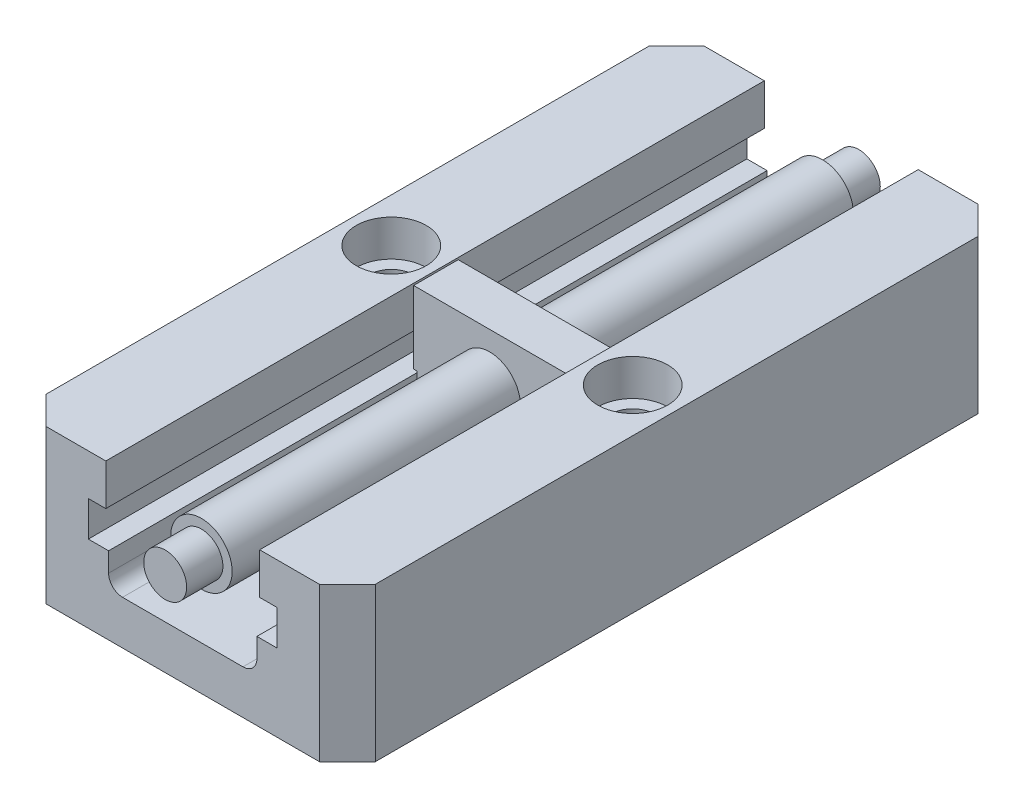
ISO-10303-21;
HEADER;
FILE_DESCRIPTION(('STEP AP214'),'2;1');
FILE_NAME('part.step','',(''),(''),'','','');
FILE_SCHEMA(('AUTOMOTIVE_DESIGN { 1 0 10303 214 1 1 1 1 }'));
ENDSEC;
DATA;
#1=APPLICATION_CONTEXT('core data for automotive mechanical design processes');
#2=APPLICATION_PROTOCOL_DEFINITION('international standard','automotive_design',2000,#1);
#3=PRODUCT_CONTEXT('',#1,'mechanical');
#4=PRODUCT('Part','Part','',(#3));
#5=PRODUCT_RELATED_PRODUCT_CATEGORY('part','',(#4));
#6=PRODUCT_DEFINITION_FORMATION('','',#4);
#7=PRODUCT_DEFINITION_CONTEXT('part definition',#1,'design');
#8=PRODUCT_DEFINITION('design','',#6,#7);
#9=PRODUCT_DEFINITION_SHAPE('','',#8);
#10=(LENGTH_UNIT() NAMED_UNIT(*) SI_UNIT(.MILLI.,.METRE.));
#11=(NAMED_UNIT(*) PLANE_ANGLE_UNIT() SI_UNIT($,.RADIAN.));
#12=(NAMED_UNIT(*) SI_UNIT($,.STERADIAN.) SOLID_ANGLE_UNIT());
#13=UNCERTAINTY_MEASURE_WITH_UNIT(LENGTH_MEASURE(1.E-05),#10,'distance_accuracy_value','');
#14=(GEOMETRIC_REPRESENTATION_CONTEXT(3) GLOBAL_UNCERTAINTY_ASSIGNED_CONTEXT((#13)) GLOBAL_UNIT_ASSIGNED_CONTEXT((#10,
#11,#12)) REPRESENTATION_CONTEXT('',''));
#15=CARTESIAN_POINT('',(0.,0.,0.));
#16=DIRECTION('',(0.,0.,1.));
#17=DIRECTION('',(1.,0.,0.));
#18=AXIS2_PLACEMENT_3D('',#15,#16,#17);
#19=CARTESIAN_POINT('',(0.,0.,79.));
#20=DIRECTION('',(0.,0.,-1.));
#21=DIRECTION('',(-1.,0.,0.));
#22=AXIS2_PLACEMENT_3D('',#19,#20,#21);
#23=CYLINDRICAL_SURFACE('',#22,7.);
#24=CARTESIAN_POINT('',(0.,0.,-5.08));
#25=DIRECTION('',(0.,0.,1.));
#26=DIRECTION('',(1.,0.,0.));
#27=AXIS2_PLACEMENT_3D('',#24,#25,#26);
#28=CIRCLE('',#27,7.);
#29=CARTESIAN_POINT('',(7.,0.,-5.08));
#30=VERTEX_POINT('',#29);
#31=EDGE_CURVE('E11',#30,#30,#28,.F.);
#32=ORIENTED_EDGE('',*,*,#31,.T.);
#33=EDGE_LOOP('',(#32));
#34=FACE_BOUND('',#33,.T.);
#35=CARTESIAN_POINT('',(0.,0.,-70.745));
#36=DIRECTION('',(0.,0.,1.));
#37=DIRECTION('',(1.,0.,0.));
#38=AXIS2_PLACEMENT_3D('',#35,#36,#37);
#39=CIRCLE('',#38,7.);
#40=CARTESIAN_POINT('',(7.,0.,-70.745));
#41=VERTEX_POINT('',#40);
#42=EDGE_CURVE('E1219',#41,#41,#39,.T.);
#43=ORIENTED_EDGE('',*,*,#42,.T.);
#44=EDGE_LOOP('',(#43));
#45=FACE_BOUND('',#44,.T.);
#46=ADVANCED_FACE('F16',(#34,#45),#23,.T.);
#47=CARTESIAN_POINT('',(0.,0.,5.08));
#48=DIRECTION('',(0.,0.,1.));
#49=DIRECTION('',(1.,0.,0.));
#50=AXIS2_PLACEMENT_3D('',#47,#48,#49);
#51=CIRCLE('',#50,7.);
#52=CARTESIAN_POINT('',(7.,0.,5.08));
#53=VERTEX_POINT('',#52);
#54=EDGE_CURVE('E1233',#53,#53,#51,.F.);
#55=ORIENTED_EDGE('',*,*,#54,.F.);
#56=EDGE_LOOP('',(#55));
#57=FACE_BOUND('',#56,.T.);
#58=CARTESIAN_POINT('',(0.,0.,70.745));
#59=DIRECTION('',(0.,0.,1.));
#60=DIRECTION('',(1.,0.,0.));
#61=AXIS2_PLACEMENT_3D('',#58,#59,#60);
#62=CIRCLE('',#61,7.);
#63=CARTESIAN_POINT('',(7.,0.,70.745));
#64=VERTEX_POINT('',#63);
#65=EDGE_CURVE('E1228',#64,#64,#62,.T.);
#66=ORIENTED_EDGE('',*,*,#65,.F.);
#67=EDGE_LOOP('',(#66));
#68=FACE_BOUND('',#67,.T.);
#69=ADVANCED_FACE('F485',(#57,#68),#23,.T.);
#70=CARTESIAN_POINT('',(27.5,11.684,0.));
#71=DIRECTION('',(0.,-1.,0.));
#72=DIRECTION('',(1.,0.,0.));
#73=AXIS2_PLACEMENT_3D('',#70,#71,#72);
#74=CYLINDRICAL_SURFACE('',#73,5.1);
#75=CARTESIAN_POINT('',(27.5,-23.3172,0.));
#76=DIRECTION('',(0.,-1.,0.));
#77=DIRECTION('',(1.,0.,0.));
#78=AXIS2_PLACEMENT_3D('',#75,#76,#77);
#79=CIRCLE('',#78,5.1);
#80=CARTESIAN_POINT('',(32.6,-23.3172,0.));
#81=VERTEX_POINT('',#80);
#82=EDGE_CURVE('E297',#81,#81,#79,.T.);
#83=ORIENTED_EDGE('',*,*,#82,.T.);
#84=EDGE_LOOP('',(#83));
#85=FACE_BOUND('',#84,.T.);
#86=CARTESIAN_POINT('',(27.5,3.3846,0.));
#87=DIRECTION('',(0.,1.,0.));
#88=DIRECTION('',(0.,0.,1.));
#89=AXIS2_PLACEMENT_3D('',#86,#87,#88);
#90=CIRCLE('',#89,5.1);
#91=CARTESIAN_POINT('',(27.5,3.3846,5.1));
#92=VERTEX_POINT('',#91);
#93=EDGE_CURVE('E285',#92,#92,#90,.F.);
#94=ORIENTED_EDGE('',*,*,#93,.F.);
#95=EDGE_LOOP('',(#94));
#96=FACE_BOUND('',#95,.T.);
#97=ADVANCED_FACE('F482',(#85,#96),#74,.F.);
#98=CARTESIAN_POINT('',(-27.5,11.684,0.));
#99=DIRECTION('',(0.,-1.,0.));
#100=DIRECTION('',(1.,0.,0.));
#101=AXIS2_PLACEMENT_3D('',#98,#99,#100);
#102=CYLINDRICAL_SURFACE('',#101,5.1);
#103=CARTESIAN_POINT('',(-27.5,-23.3172,0.));
#104=DIRECTION('',(0.,-1.,0.));
#105=DIRECTION('',(1.,0.,0.));
#106=AXIS2_PLACEMENT_3D('',#103,#104,#105);
#107=CIRCLE('',#106,5.1);
#108=CARTESIAN_POINT('',(-22.4,-23.3172,0.));
#109=VERTEX_POINT('',#108);
#110=EDGE_CURVE('E289',#109,#109,#107,.T.);
#111=ORIENTED_EDGE('',*,*,#110,.T.);
#112=EDGE_LOOP('',(#111));
#113=FACE_BOUND('',#112,.T.);
#114=CARTESIAN_POINT('',(-27.5,3.3846,0.));
#115=DIRECTION('',(0.,1.,0.));
#116=DIRECTION('',(0.,0.,1.));
#117=AXIS2_PLACEMENT_3D('',#114,#115,#116);
#118=CIRCLE('',#117,5.1);
#119=CARTESIAN_POINT('',(-27.5,3.3846,5.09999999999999));
#120=VERTEX_POINT('',#119);
#121=EDGE_CURVE('E260',#120,#120,#118,.F.);
#122=ORIENTED_EDGE('',*,*,#121,.F.);
#123=EDGE_LOOP('',(#122));
#124=FACE_BOUND('',#123,.T.);
#125=ADVANCED_FACE('F484',(#113,#124),#102,.F.);
#126=CARTESIAN_POINT('',(17.526,11.684,75.));
#127=DIRECTION('',(0.,-1.,0.));
#128=DIRECTION('',(1.,0.,0.));
#129=AXIS2_PLACEMENT_3D('',#126,#127,#128);
#130=PLANE('',#129);
#131=CARTESIAN_POINT('',(27.5,11.684,0.));
#132=DIRECTION('',(0.,1.,0.));
#133=DIRECTION('',(0.,0.,1.));
#134=AXIS2_PLACEMENT_3D('',#131,#132,#133);
#135=CIRCLE('',#134,7.9629);
#136=CARTESIAN_POINT('',(27.5,11.684,7.9629));
#137=VERTEX_POINT('',#136);
#138=EDGE_CURVE('E248',#137,#137,#135,.T.);
#139=ORIENTED_EDGE('',*,*,#138,.F.);
#140=EDGE_LOOP('',(#139));
#141=FACE_BOUND('',#140,.T.);
#142=DIRECTION('',(0.,0.,-1.));
#143=VECTOR('',#142,1.);
#144=CARTESIAN_POINT('',(37.5,11.684,75.));
#145=LINE('',#144,#143);
#146=CARTESIAN_POINT('',(37.5,11.684,68.65));
#147=VERTEX_POINT('',#146);
#148=CARTESIAN_POINT('',(37.5,11.684,-68.65));
#149=VERTEX_POINT('',#148);
#150=EDGE_CURVE('E391',#147,#149,#145,.T.);
#151=ORIENTED_EDGE('',*,*,#150,.T.);
#152=DIRECTION('',(0.707106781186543,0.,0.707106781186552));
#153=VECTOR('',#152,1.);
#154=CARTESIAN_POINT('',(37.5,11.684,-68.65));
#155=LINE('',#154,#153);
#156=CARTESIAN_POINT('',(31.15,11.684,-75.));
#157=VERTEX_POINT('',#156);
#158=EDGE_CURVE('E315',#157,#149,#155,.T.);
#159=ORIENTED_EDGE('',*,*,#158,.F.);
#160=DIRECTION('',(-1.,0.,0.));
#161=VECTOR('',#160,1.);
#162=CARTESIAN_POINT('',(17.526,11.684,-75.));
#163=LINE('',#162,#161);
#164=CARTESIAN_POINT('',(17.526,11.684,-75.));
#165=VERTEX_POINT('',#164);
#166=EDGE_CURVE('E354',#157,#165,#163,.T.);
#167=ORIENTED_EDGE('',*,*,#166,.T.);
#168=DIRECTION('',(0.,0.,-1.));
#169=VECTOR('',#168,1.);
#170=CARTESIAN_POINT('',(17.526,11.684,75.));
#171=LINE('',#170,#169);
#172=CARTESIAN_POINT('',(17.526,11.684,75.));
#173=VERTEX_POINT('',#172);
#174=EDGE_CURVE('E24',#173,#165,#171,.T.);
#175=ORIENTED_EDGE('',*,*,#174,.F.);
#176=DIRECTION('',(-1.,0.,0.));
#177=VECTOR('',#176,1.);
#178=CARTESIAN_POINT('',(17.526,11.684,75.));
#179=LINE('',#178,#177);
#180=CARTESIAN_POINT('',(31.15,11.684,75.));
#181=VERTEX_POINT('',#180);
#182=EDGE_CURVE('E356',#181,#173,#179,.T.);
#183=ORIENTED_EDGE('',*,*,#182,.F.);
#184=DIRECTION('',(-0.707106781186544,0.,0.707106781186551));
#185=VECTOR('',#184,1.);
#186=CARTESIAN_POINT('',(31.15,11.684,75.));
#187=LINE('',#186,#185);
#188=EDGE_CURVE('E320',#147,#181,#187,.T.);
#189=ORIENTED_EDGE('',*,*,#188,.F.);
#190=EDGE_LOOP('',(#151,#159,#167,#175,#183,#189));
#191=FACE_BOUND('',#190,.T.);
#192=ADVANCED_FACE('F18',(#141,#191),#130,.F.);
#193=CARTESIAN_POINT('',(17.526,11.684,75.));
#194=DIRECTION('',(1.,0.,0.));
#195=DIRECTION('',(0.,0.,-1.));
#196=AXIS2_PLACEMENT_3D('',#193,#194,#195);
#197=PLANE('',#196);
#198=DIRECTION('',(0.,-1.,0.));
#199=VECTOR('',#198,1.);
#200=CARTESIAN_POINT('',(17.526,11.684,-75.));
#201=LINE('',#200,#199);
#202=CARTESIAN_POINT('',(17.526,2.286,-75.));
#203=VERTEX_POINT('',#202);
#204=EDGE_CURVE('E393',#165,#203,#201,.T.);
#205=ORIENTED_EDGE('',*,*,#204,.T.);
#206=DIRECTION('',(0.,0.,-1.));
#207=VECTOR('',#206,1.);
#208=CARTESIAN_POINT('',(17.526,2.286,75.));
#209=LINE('',#208,#207);
#210=CARTESIAN_POINT('',(17.526,2.286,75.));
#211=VERTEX_POINT('',#210);
#212=EDGE_CURVE('E471',#211,#203,#209,.T.);
#213=ORIENTED_EDGE('',*,*,#212,.F.);
#214=DIRECTION('',(0.,-1.,0.));
#215=VECTOR('',#214,1.);
#216=CARTESIAN_POINT('',(17.526,11.684,75.));
#217=LINE('',#216,#215);
#218=EDGE_CURVE('E358',#173,#211,#217,.T.);
#219=ORIENTED_EDGE('',*,*,#218,.F.);
#220=ORIENTED_EDGE('',*,*,#174,.T.);
#221=EDGE_LOOP('',(#205,#213,#219,#220));
#222=FACE_BOUND('',#221,.T.);
#223=ADVANCED_FACE('F673',(#222),#197,.F.);
#224=CARTESIAN_POINT('',(17.526,2.286,75.));
#225=DIRECTION('',(0.,1.,0.));
#226=DIRECTION('',(-1.,0.,0.));
#227=AXIS2_PLACEMENT_3D('',#224,#225,#226);
#228=PLANE('',#227);
#229=DIRECTION('',(1.,0.,0.));
#230=VECTOR('',#229,1.);
#231=CARTESIAN_POINT('',(17.526,2.286,-75.));
#232=LINE('',#231,#230);
#233=CARTESIAN_POINT('',(21.5,2.286,-75.));
#234=VERTEX_POINT('',#233);
#235=EDGE_CURVE('E395',#203,#234,#232,.T.);
#236=ORIENTED_EDGE('',*,*,#235,.T.);
#237=DIRECTION('',(0.,0.,-1.));
#238=VECTOR('',#237,1.);
#239=CARTESIAN_POINT('',(21.5,2.286,75.));
#240=LINE('',#239,#238);
#241=CARTESIAN_POINT('',(21.5,2.286,75.));
#242=VERTEX_POINT('',#241);
#243=EDGE_CURVE('E468',#242,#234,#240,.T.);
#244=ORIENTED_EDGE('',*,*,#243,.F.);
#245=DIRECTION('',(1.,0.,0.));
#246=VECTOR('',#245,1.);
#247=CARTESIAN_POINT('',(17.526,2.286,75.));
#248=LINE('',#247,#246);
#249=EDGE_CURVE('E361',#211,#242,#248,.T.);
#250=ORIENTED_EDGE('',*,*,#249,.F.);
#251=ORIENTED_EDGE('',*,*,#212,.T.);
#252=EDGE_LOOP('',(#236,#244,#250,#251));
#253=FACE_BOUND('',#252,.T.);
#254=ADVANCED_FACE('F668',(#253),#228,.F.);
#255=CARTESIAN_POINT('',(21.5,2.286,75.));
#256=DIRECTION('',(1.,0.,0.));
#257=DIRECTION('',(0.,0.,-1.));
#258=AXIS2_PLACEMENT_3D('',#255,#256,#257);
#259=PLANE('',#258);
#260=DIRECTION('',(0.,-1.,0.));
#261=VECTOR('',#260,1.);
#262=CARTESIAN_POINT('',(21.5,2.286,-75.));
#263=LINE('',#262,#261);
#264=CARTESIAN_POINT('',(21.5,-5.715,-75.));
#265=VERTEX_POINT('',#264);
#266=EDGE_CURVE('E397',#234,#265,#263,.T.);
#267=ORIENTED_EDGE('',*,*,#266,.T.);
#268=DIRECTION('',(0.,0.,-1.));
#269=VECTOR('',#268,1.);
#270=CARTESIAN_POINT('',(21.5,-5.715,75.));
#271=LINE('',#270,#269);
#272=CARTESIAN_POINT('',(21.5,-5.715,75.));
#273=VERTEX_POINT('',#272);
#274=EDGE_CURVE('E465',#273,#265,#271,.T.);
#275=ORIENTED_EDGE('',*,*,#274,.F.);
#276=DIRECTION('',(0.,-1.,0.));
#277=VECTOR('',#276,1.);
#278=CARTESIAN_POINT('',(21.5,2.286,75.));
#279=LINE('',#278,#277);
#280=EDGE_CURVE('E363',#242,#273,#279,.T.);
#281=ORIENTED_EDGE('',*,*,#280,.F.);
#282=ORIENTED_EDGE('',*,*,#243,.T.);
#283=EDGE_LOOP('',(#267,#275,#281,#282));
#284=FACE_BOUND('',#283,.T.);
#285=ADVANCED_FACE('F663',(#284),#259,.F.);
#286=CARTESIAN_POINT('',(21.5,-5.715,75.));
#287=DIRECTION('',(0.,-1.,0.));
#288=DIRECTION('',(0.,0.,-1.));
#289=AXIS2_PLACEMENT_3D('',#286,#287,#288);
#290=PLANE('',#289);
#291=DIRECTION('',(-1.,0.,0.));
#292=VECTOR('',#291,1.);
#293=CARTESIAN_POINT('',(21.5,-5.715,-75.));
#294=LINE('',#293,#292);
#295=CARTESIAN_POINT('',(16.891,-5.715,-75.));
#296=VERTEX_POINT('',#295);
#297=EDGE_CURVE('E399',#265,#296,#294,.T.);
#298=ORIENTED_EDGE('',*,*,#297,.T.);
#299=DIRECTION('',(0.,0.,-1.));
#300=VECTOR('',#299,1.);
#301=CARTESIAN_POINT('',(16.891,-5.715,75.));
#302=LINE('',#301,#300);
#303=CARTESIAN_POINT('',(16.891,-5.715,75.));
#304=VERTEX_POINT('',#303);
#305=EDGE_CURVE('E462',#304,#296,#302,.T.);
#306=ORIENTED_EDGE('',*,*,#305,.F.);
#307=DIRECTION('',(-1.,0.,0.));
#308=VECTOR('',#307,1.);
#309=CARTESIAN_POINT('',(21.5,-5.715,75.));
#310=LINE('',#309,#308);
#311=EDGE_CURVE('E365',#273,#304,#310,.T.);
#312=ORIENTED_EDGE('',*,*,#311,.F.);
#313=ORIENTED_EDGE('',*,*,#274,.T.);
#314=EDGE_LOOP('',(#298,#306,#312,#313));
#315=FACE_BOUND('',#314,.T.);
#316=ADVANCED_FACE('F659',(#315),#290,.F.);
#317=CARTESIAN_POINT('',(16.891,-5.715,75.));
#318=DIRECTION('',(1.,0.,0.));
#319=DIRECTION('',(0.,0.,-1.));
#320=AXIS2_PLACEMENT_3D('',#317,#318,#319);
#321=PLANE('',#320);
#322=DIRECTION('',(0.,-1.,0.));
#323=VECTOR('',#322,1.);
#324=CARTESIAN_POINT('',(16.891,-5.715,-75.));
#325=LINE('',#324,#323);
#326=CARTESIAN_POINT('',(16.891,-10.1346,-75.));
#327=VERTEX_POINT('',#326);
#328=EDGE_CURVE('E401',#296,#327,#325,.T.);
#329=ORIENTED_EDGE('',*,*,#328,.T.);
#330=DIRECTION('',(0.,0.,-1.));
#331=VECTOR('',#330,1.);
#332=CARTESIAN_POINT('',(16.891,-10.1346,75.));
#333=LINE('',#332,#331);
#334=CARTESIAN_POINT('',(16.891,-10.1346,75.));
#335=VERTEX_POINT('',#334);
#336=EDGE_CURVE('E459',#335,#327,#333,.T.);
#337=ORIENTED_EDGE('',*,*,#336,.F.);
#338=DIRECTION('',(0.,-1.,0.));
#339=VECTOR('',#338,1.);
#340=CARTESIAN_POINT('',(16.891,-5.715,75.));
#341=LINE('',#340,#339);
#342=EDGE_CURVE('E367',#304,#335,#341,.T.);
#343=ORIENTED_EDGE('',*,*,#342,.F.);
#344=ORIENTED_EDGE('',*,*,#305,.T.);
#345=EDGE_LOOP('',(#329,#337,#343,#344));
#346=FACE_BOUND('',#345,.T.);
#347=ADVANCED_FACE('F655',(#346),#321,.F.);
#348=CARTESIAN_POINT('',(13.716,-10.1346,75.));
#349=DIRECTION('',(0.,0.,-1.));
#350=DIRECTION('',(-1.,0.,0.));
#351=AXIS2_PLACEMENT_3D('',#348,#349,#350);
#352=CYLINDRICAL_SURFACE('',#351,3.175);
#353=CARTESIAN_POINT('',(13.716,-10.1346,-75.));
#354=DIRECTION('',(0.,0.,-1.));
#355=DIRECTION('',(-1.,0.,0.));
#356=AXIS2_PLACEMENT_3D('',#353,#354,#355);
#357=CIRCLE('',#356,3.175);
#358=CARTESIAN_POINT('',(13.716,-13.3096,-75.));
#359=VERTEX_POINT('',#358);
#360=EDGE_CURVE('E403',#327,#359,#357,.T.);
#361=ORIENTED_EDGE('',*,*,#360,.T.);
#362=DIRECTION('',(0.,0.,-1.));
#363=VECTOR('',#362,1.);
#364=CARTESIAN_POINT('',(13.716,-13.3096,75.));
#365=LINE('',#364,#363);
#366=CARTESIAN_POINT('',(13.716,-13.3096,75.));
#367=VERTEX_POINT('',#366);
#368=EDGE_CURVE('E456',#367,#359,#365,.T.);
#369=ORIENTED_EDGE('',*,*,#368,.F.);
#370=CARTESIAN_POINT('',(13.716,-10.1346,75.));
#371=DIRECTION('',(0.,0.,-1.));
#372=DIRECTION('',(-1.,0.,0.));
#373=AXIS2_PLACEMENT_3D('',#370,#371,#372);
#374=CIRCLE('',#373,3.175);
#375=EDGE_CURVE('E369',#335,#367,#374,.T.);
#376=ORIENTED_EDGE('',*,*,#375,.F.);
#377=ORIENTED_EDGE('',*,*,#336,.T.);
#378=EDGE_LOOP('',(#361,#369,#376,#377));
#379=FACE_BOUND('',#378,.T.);
#380=ADVANCED_FACE('F615',(#379),#352,.F.);
#381=CARTESIAN_POINT('',(13.716,-13.3096,75.));
#382=DIRECTION('',(0.,-1.,0.));
#383=DIRECTION('',(1.,0.,0.));
#384=AXIS2_PLACEMENT_3D('',#381,#382,#383);
#385=PLANE('',#384);
#386=DIRECTION('',(0.,0.,-1.));
#387=VECTOR('',#386,1.);
#388=CARTESIAN_POINT('',(13.208,-13.3096,5.08));
#389=LINE('',#388,#387);
#390=CARTESIAN_POINT('',(13.208,-13.3096,5.08));
#391=VERTEX_POINT('',#390);
#392=CARTESIAN_POINT('',(13.208,-13.3096,-5.08));
#393=VERTEX_POINT('',#392);
#394=EDGE_CURVE('E36',#391,#393,#389,.T.);
#395=ORIENTED_EDGE('',*,*,#394,.F.);
#396=DIRECTION('',(1.,0.,0.));
#397=VECTOR('',#396,1.);
#398=CARTESIAN_POINT('',(-13.208,-13.3096,5.08));
#399=LINE('',#398,#397);
#400=CARTESIAN_POINT('',(-13.208,-13.3096,5.08));
#401=VERTEX_POINT('',#400);
#402=EDGE_CURVE('E31',#401,#391,#399,.T.);
#403=ORIENTED_EDGE('',*,*,#402,.F.);
#404=DIRECTION('',(0.,0.,-1.));
#405=VECTOR('',#404,1.);
#406=CARTESIAN_POINT('',(-13.208,-13.3096,5.08));
#407=LINE('',#406,#405);
#408=CARTESIAN_POINT('',(-13.208,-13.3096,-5.08));
#409=VERTEX_POINT('',#408);
#410=EDGE_CURVE('E1283',#401,#409,#407,.T.);
#411=ORIENTED_EDGE('',*,*,#410,.T.);
#412=DIRECTION('',(1.,0.,0.));
#413=VECTOR('',#412,1.);
#414=CARTESIAN_POINT('',(-13.208,-13.3096,-5.08));
#415=LINE('',#414,#413);
#416=EDGE_CURVE('E1258',#409,#393,#415,.T.);
#417=ORIENTED_EDGE('',*,*,#416,.T.);
#418=EDGE_LOOP('',(#395,#403,#411,#417));
#419=FACE_BOUND('',#418,.T.);
#420=CARTESIAN_POINT('',(0.,-13.3096,50.));
#421=DIRECTION('',(0.,-1.,0.));
#422=DIRECTION('',(1.,0.,0.));
#423=AXIS2_PLACEMENT_3D('',#420,#421,#422);
#424=CIRCLE('',#423,4.00685);
#425=CARTESIAN_POINT('',(4.00685000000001,-13.3096,50.));
#426=VERTEX_POINT('',#425);
#427=EDGE_CURVE('E312',#426,#426,#424,.T.);
#428=ORIENTED_EDGE('',*,*,#427,.T.);
#429=EDGE_LOOP('',(#428));
#430=FACE_BOUND('',#429,.T.);
#431=CARTESIAN_POINT('',(0.,-13.3096,-50.));
#432=DIRECTION('',(0.,-1.,0.));
#433=DIRECTION('',(1.,0.,0.));
#434=AXIS2_PLACEMENT_3D('',#431,#432,#433);
#435=CIRCLE('',#434,4.00685);
#436=CARTESIAN_POINT('',(4.00685000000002,-13.3096,-50.));
#437=VERTEX_POINT('',#436);
#438=EDGE_CURVE('E309',#437,#437,#435,.T.);
#439=ORIENTED_EDGE('',*,*,#438,.T.);
#440=EDGE_LOOP('',(#439));
#441=FACE_BOUND('',#440,.T.);
#442=DIRECTION('',(-1.,0.,0.));
#443=VECTOR('',#442,1.);
#444=CARTESIAN_POINT('',(13.716,-13.3096,-75.));
#445=LINE('',#444,#443);
#446=CARTESIAN_POINT('',(-13.716,-13.3096,-75.));
#447=VERTEX_POINT('',#446);
#448=EDGE_CURVE('E405',#359,#447,#445,.T.);
#449=ORIENTED_EDGE('',*,*,#448,.T.);
#450=DIRECTION('',(0.,0.,-1.));
#451=VECTOR('',#450,1.);
#452=CARTESIAN_POINT('',(-13.716,-13.3096,75.));
#453=LINE('',#452,#451);
#454=CARTESIAN_POINT('',(-13.716,-13.3096,75.));
#455=VERTEX_POINT('',#454);
#456=EDGE_CURVE('E453',#455,#447,#453,.T.);
#457=ORIENTED_EDGE('',*,*,#456,.F.);
#458=DIRECTION('',(-1.,0.,0.));
#459=VECTOR('',#458,1.);
#460=CARTESIAN_POINT('',(13.716,-13.3096,75.));
#461=LINE('',#460,#459);
#462=EDGE_CURVE('E371',#367,#455,#461,.T.);
#463=ORIENTED_EDGE('',*,*,#462,.F.);
#464=ORIENTED_EDGE('',*,*,#368,.T.);
#465=EDGE_LOOP('',(#449,#457,#463,#464));
#466=FACE_BOUND('',#465,.T.);
#467=ADVANCED_FACE('F611',(#419,#430,#441,#466),#385,.F.);
#468=CARTESIAN_POINT('',(-13.716,-10.1346,75.));
#469=DIRECTION('',(0.,0.,-1.));
#470=DIRECTION('',(-1.,0.,0.));
#471=AXIS2_PLACEMENT_3D('',#468,#469,#470);
#472=CYLINDRICAL_SURFACE('',#471,3.175);
#473=CARTESIAN_POINT('',(-13.716,-10.1346,-75.));
#474=DIRECTION('',(0.,0.,-1.));
#475=DIRECTION('',(1.,0.,0.));
#476=AXIS2_PLACEMENT_3D('',#473,#474,#475);
#477=CIRCLE('',#476,3.175);
#478=CARTESIAN_POINT('',(-16.891,-10.1346,-75.));
#479=VERTEX_POINT('',#478);
#480=EDGE_CURVE('E407',#447,#479,#477,.T.);
#481=ORIENTED_EDGE('',*,*,#480,.T.);
#482=DIRECTION('',(0.,0.,-1.));
#483=VECTOR('',#482,1.);
#484=CARTESIAN_POINT('',(-16.891,-10.1346,75.));
#485=LINE('',#484,#483);
#486=CARTESIAN_POINT('',(-16.891,-10.1346,75.));
#487=VERTEX_POINT('',#486);
#488=EDGE_CURVE('E450',#487,#479,#485,.T.);
#489=ORIENTED_EDGE('',*,*,#488,.F.);
#490=CARTESIAN_POINT('',(-13.716,-10.1346,75.));
#491=DIRECTION('',(0.,0.,-1.));
#492=DIRECTION('',(1.,0.,0.));
#493=AXIS2_PLACEMENT_3D('',#490,#491,#492);
#494=CIRCLE('',#493,3.175);
#495=EDGE_CURVE('E373',#455,#487,#494,.T.);
#496=ORIENTED_EDGE('',*,*,#495,.F.);
#497=ORIENTED_EDGE('',*,*,#456,.T.);
#498=EDGE_LOOP('',(#481,#489,#496,#497));
#499=FACE_BOUND('',#498,.T.);
#500=ADVANCED_FACE('F614',(#499),#472,.F.);
#501=CARTESIAN_POINT('',(-16.891,-5.715,75.));
#502=DIRECTION('',(-1.,0.,0.));
#503=DIRECTION('',(0.,0.,1.));
#504=AXIS2_PLACEMENT_3D('',#501,#502,#503);
#505=PLANE('',#504);
#506=DIRECTION('',(0.,1.,0.));
#507=VECTOR('',#506,1.);
#508=CARTESIAN_POINT('',(-16.891,-5.715,-75.));
#509=LINE('',#508,#507);
#510=CARTESIAN_POINT('',(-16.891,-5.715,-75.));
#511=VERTEX_POINT('',#510);
#512=EDGE_CURVE('E409',#479,#511,#509,.T.);
#513=ORIENTED_EDGE('',*,*,#512,.T.);
#514=DIRECTION('',(0.,0.,-1.));
#515=VECTOR('',#514,1.);
#516=CARTESIAN_POINT('',(-16.891,-5.715,75.));
#517=LINE('',#516,#515);
#518=CARTESIAN_POINT('',(-16.891,-5.715,75.));
#519=VERTEX_POINT('',#518);
#520=EDGE_CURVE('E447',#519,#511,#517,.T.);
#521=ORIENTED_EDGE('',*,*,#520,.F.);
#522=DIRECTION('',(0.,1.,0.));
#523=VECTOR('',#522,1.);
#524=CARTESIAN_POINT('',(-16.891,-5.715,75.));
#525=LINE('',#524,#523);
#526=EDGE_CURVE('E375',#487,#519,#525,.T.);
#527=ORIENTED_EDGE('',*,*,#526,.F.);
#528=ORIENTED_EDGE('',*,*,#488,.T.);
#529=EDGE_LOOP('',(#513,#521,#527,#528));
#530=FACE_BOUND('',#529,.T.);
#531=ADVANCED_FACE('F636',(#530),#505,.F.);
#532=CARTESIAN_POINT('',(-21.5,-5.715,75.));
#533=DIRECTION('',(0.,-1.,0.));
#534=DIRECTION('',(0.,0.,-1.));
#535=AXIS2_PLACEMENT_3D('',#532,#533,#534);
#536=PLANE('',#535);
#537=DIRECTION('',(-1.,0.,0.));
#538=VECTOR('',#537,1.);
#539=CARTESIAN_POINT('',(-21.5,-5.715,-75.));
#540=LINE('',#539,#538);
#541=CARTESIAN_POINT('',(-21.5,-5.715,-75.));
#542=VERTEX_POINT('',#541);
#543=EDGE_CURVE('E411',#511,#542,#540,.T.);
#544=ORIENTED_EDGE('',*,*,#543,.T.);
#545=DIRECTION('',(0.,0.,-1.));
#546=VECTOR('',#545,1.);
#547=CARTESIAN_POINT('',(-21.5,-5.715,75.));
#548=LINE('',#547,#546);
#549=CARTESIAN_POINT('',(-21.5,-5.715,75.));
#550=VERTEX_POINT('',#549);
#551=EDGE_CURVE('E444',#550,#542,#548,.T.);
#552=ORIENTED_EDGE('',*,*,#551,.F.);
#553=DIRECTION('',(-1.,0.,0.));
#554=VECTOR('',#553,1.);
#555=CARTESIAN_POINT('',(-21.5,-5.715,75.));
#556=LINE('',#555,#554);
#557=EDGE_CURVE('E377',#519,#550,#556,.T.);
#558=ORIENTED_EDGE('',*,*,#557,.F.);
#559=ORIENTED_EDGE('',*,*,#520,.T.);
#560=EDGE_LOOP('',(#544,#552,#558,#559));
#561=FACE_BOUND('',#560,.T.);
#562=ADVANCED_FACE('F640',(#561),#536,.F.);
#563=CARTESIAN_POINT('',(-21.5,2.286,75.));
#564=DIRECTION('',(-1.,0.,0.));
#565=DIRECTION('',(0.,0.,1.));
#566=AXIS2_PLACEMENT_3D('',#563,#564,#565);
#567=PLANE('',#566);
#568=DIRECTION('',(0.,1.,0.));
#569=VECTOR('',#568,1.);
#570=CARTESIAN_POINT('',(-21.5,2.286,-75.));
#571=LINE('',#570,#569);
#572=CARTESIAN_POINT('',(-21.5,2.286,-75.));
#573=VERTEX_POINT('',#572);
#574=EDGE_CURVE('E413',#542,#573,#571,.T.);
#575=ORIENTED_EDGE('',*,*,#574,.T.);
#576=DIRECTION('',(0.,0.,-1.));
#577=VECTOR('',#576,1.);
#578=CARTESIAN_POINT('',(-21.5,2.286,75.));
#579=LINE('',#578,#577);
#580=CARTESIAN_POINT('',(-21.5,2.286,75.));
#581=VERTEX_POINT('',#580);
#582=EDGE_CURVE('E441',#581,#573,#579,.T.);
#583=ORIENTED_EDGE('',*,*,#582,.F.);
#584=DIRECTION('',(0.,1.,0.));
#585=VECTOR('',#584,1.);
#586=CARTESIAN_POINT('',(-21.5,2.286,75.));
#587=LINE('',#586,#585);
#588=EDGE_CURVE('E379',#550,#581,#587,.T.);
#589=ORIENTED_EDGE('',*,*,#588,.F.);
#590=ORIENTED_EDGE('',*,*,#551,.T.);
#591=EDGE_LOOP('',(#575,#583,#589,#590));
#592=FACE_BOUND('',#591,.T.);
#593=ADVANCED_FACE('F710',(#592),#567,.F.);
#594=CARTESIAN_POINT('',(-17.526,2.286,75.));
#595=DIRECTION('',(0.,1.,0.));
#596=DIRECTION('',(-1.,0.,0.));
#597=AXIS2_PLACEMENT_3D('',#594,#595,#596);
#598=PLANE('',#597);
#599=DIRECTION('',(1.,0.,0.));
#600=VECTOR('',#599,1.);
#601=CARTESIAN_POINT('',(-17.526,2.286,-75.));
#602=LINE('',#601,#600);
#603=CARTESIAN_POINT('',(-17.526,2.286,-75.));
#604=VERTEX_POINT('',#603);
#605=EDGE_CURVE('E415',#573,#604,#602,.T.);
#606=ORIENTED_EDGE('',*,*,#605,.T.);
#607=DIRECTION('',(0.,0.,-1.));
#608=VECTOR('',#607,1.);
#609=CARTESIAN_POINT('',(-17.526,2.286,75.));
#610=LINE('',#609,#608);
#611=CARTESIAN_POINT('',(-17.526,2.286,75.));
#612=VERTEX_POINT('',#611);
#613=EDGE_CURVE('E438',#612,#604,#610,.T.);
#614=ORIENTED_EDGE('',*,*,#613,.F.);
#615=DIRECTION('',(1.,0.,0.));
#616=VECTOR('',#615,1.);
#617=CARTESIAN_POINT('',(-17.526,2.286,75.));
#618=LINE('',#617,#616);
#619=EDGE_CURVE('E381',#581,#612,#618,.T.);
#620=ORIENTED_EDGE('',*,*,#619,.F.);
#621=ORIENTED_EDGE('',*,*,#582,.T.);
#622=EDGE_LOOP('',(#606,#614,#620,#621));
#623=FACE_BOUND('',#622,.T.);
#624=ADVANCED_FACE('F708',(#623),#598,.F.);
#625=CARTESIAN_POINT('',(-17.526,11.684,75.));
#626=DIRECTION('',(-1.,0.,0.));
#627=DIRECTION('',(0.,0.,1.));
#628=AXIS2_PLACEMENT_3D('',#625,#626,#627);
#629=PLANE('',#628);
#630=DIRECTION('',(0.,1.,0.));
#631=VECTOR('',#630,1.);
#632=CARTESIAN_POINT('',(-17.526,11.684,-75.));
#633=LINE('',#632,#631);
#634=CARTESIAN_POINT('',(-17.526,11.684,-75.));
#635=VERTEX_POINT('',#634);
#636=EDGE_CURVE('E417',#604,#635,#633,.T.);
#637=ORIENTED_EDGE('',*,*,#636,.T.);
#638=DIRECTION('',(0.,0.,-1.));
#639=VECTOR('',#638,1.);
#640=CARTESIAN_POINT('',(-17.526,11.684,75.));
#641=LINE('',#640,#639);
#642=CARTESIAN_POINT('',(-17.526,11.684,75.));
#643=VERTEX_POINT('',#642);
#644=EDGE_CURVE('E435',#643,#635,#641,.T.);
#645=ORIENTED_EDGE('',*,*,#644,.F.);
#646=DIRECTION('',(0.,1.,0.));
#647=VECTOR('',#646,1.);
#648=CARTESIAN_POINT('',(-17.526,11.684,75.));
#649=LINE('',#648,#647);
#650=EDGE_CURVE('E383',#612,#643,#649,.T.);
#651=ORIENTED_EDGE('',*,*,#650,.F.);
#652=ORIENTED_EDGE('',*,*,#613,.T.);
#653=EDGE_LOOP('',(#637,#645,#651,#652));
#654=FACE_BOUND('',#653,.T.);
#655=ADVANCED_FACE('F702',(#654),#629,.F.);
#656=CARTESIAN_POINT('',(-37.5,11.684,75.));
#657=DIRECTION('',(0.,-1.,0.));
#658=DIRECTION('',(0.,0.,-1.));
#659=AXIS2_PLACEMENT_3D('',#656,#657,#658);
#660=PLANE('',#659);
#661=CARTESIAN_POINT('',(-27.5,11.684,0.));
#662=DIRECTION('',(0.,1.,0.));
#663=DIRECTION('',(0.,0.,1.));
#664=AXIS2_PLACEMENT_3D('',#661,#662,#663);
#665=CIRCLE('',#664,7.9629);
#666=CARTESIAN_POINT('',(-27.5,11.684,7.96289999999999));
#667=VERTEX_POINT('',#666);
#668=EDGE_CURVE('E261',#667,#667,#665,.T.);
#669=ORIENTED_EDGE('',*,*,#668,.F.);
#670=EDGE_LOOP('',(#669));
#671=FACE_BOUND('',#670,.T.);
#672=DIRECTION('',(0.,0.,-1.));
#673=VECTOR('',#672,1.);
#674=CARTESIAN_POINT('',(-37.5,11.684,75.));
#675=LINE('',#674,#673);
#676=CARTESIAN_POINT('',(-37.5,11.684,68.65));
#677=VERTEX_POINT('',#676);
#678=CARTESIAN_POINT('',(-37.5,11.684,-68.65));
#679=VERTEX_POINT('',#678);
#680=EDGE_CURVE('E432',#677,#679,#675,.T.);
#681=ORIENTED_EDGE('',*,*,#680,.F.);
#682=DIRECTION('',(-0.70710678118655,0.,-0.707106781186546));
#683=VECTOR('',#682,1.);
#684=CARTESIAN_POINT('',(-37.5,11.684,68.65));
#685=LINE('',#684,#683);
#686=CARTESIAN_POINT('',(-31.15,11.684,75.));
#687=VERTEX_POINT('',#686);
#688=EDGE_CURVE('E332',#687,#677,#685,.T.);
#689=ORIENTED_EDGE('',*,*,#688,.F.);
#690=DIRECTION('',(-1.,0.,0.));
#691=VECTOR('',#690,1.);
#692=CARTESIAN_POINT('',(-37.5,11.684,75.));
#693=LINE('',#692,#691);
#694=EDGE_CURVE('E385',#643,#687,#693,.T.);
#695=ORIENTED_EDGE('',*,*,#694,.F.);
#696=ORIENTED_EDGE('',*,*,#644,.T.);
#697=DIRECTION('',(-1.,0.,0.));
#698=VECTOR('',#697,1.);
#699=CARTESIAN_POINT('',(-37.5,11.684,-75.));
#700=LINE('',#699,#698);
#701=CARTESIAN_POINT('',(-31.15,11.684,-75.));
#702=VERTEX_POINT('',#701);
#703=EDGE_CURVE('E419',#635,#702,#700,.T.);
#704=ORIENTED_EDGE('',*,*,#703,.T.);
#705=DIRECTION('',(0.70710678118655,0.,-0.707106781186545));
#706=VECTOR('',#705,1.);
#707=CARTESIAN_POINT('',(-31.15,11.684,-75.));
#708=LINE('',#707,#706);
#709=EDGE_CURVE('E326',#679,#702,#708,.T.);
#710=ORIENTED_EDGE('',*,*,#709,.F.);
#711=EDGE_LOOP('',(#681,#689,#695,#696,#704,#710));
#712=FACE_BOUND('',#711,.T.);
#713=ADVANCED_FACE('F695',(#671,#712),#660,.F.);
#714=CARTESIAN_POINT('',(-37.5,-23.3172,75.));
#715=DIRECTION('',(1.,0.,0.));
#716=DIRECTION('',(0.,0.,-1.));
#717=AXIS2_PLACEMENT_3D('',#714,#715,#716);
#718=PLANE('',#717);
#719=DIRECTION('',(0.,0.,-1.));
#720=VECTOR('',#719,1.);
#721=CARTESIAN_POINT('',(-37.5,-23.3172,75.));
#722=LINE('',#721,#720);
#723=CARTESIAN_POINT('',(-37.5,-23.3172,68.65));
#724=VERTEX_POINT('',#723);
#725=CARTESIAN_POINT('',(-37.5,-23.3172,-68.65));
#726=VERTEX_POINT('',#725);
#727=EDGE_CURVE('E429',#724,#726,#722,.T.);
#728=ORIENTED_EDGE('',*,*,#727,.F.);
#729=DIRECTION('',(0.,1.,0.));
#730=VECTOR('',#729,1.);
#731=CARTESIAN_POINT('',(-37.5,-23.3172,68.65));
#732=LINE('',#731,#730);
#733=EDGE_CURVE('E322',#724,#677,#732,.T.);
#734=ORIENTED_EDGE('',*,*,#733,.T.);
#735=ORIENTED_EDGE('',*,*,#680,.T.);
#736=DIRECTION('',(0.,1.,0.));
#737=VECTOR('',#736,1.);
#738=CARTESIAN_POINT('',(-37.5,-23.3172,-68.65));
#739=LINE('',#738,#737);
#740=EDGE_CURVE('E349',#726,#679,#739,.T.);
#741=ORIENTED_EDGE('',*,*,#740,.F.);
#742=EDGE_LOOP('',(#728,#734,#735,#741));
#743=FACE_BOUND('',#742,.T.);
#744=ADVANCED_FACE('F691',(#743),#718,.F.);
#745=CARTESIAN_POINT('',(-37.5,-23.3172,75.));
#746=DIRECTION('',(0.,1.,0.));
#747=DIRECTION('',(-1.,0.,0.));
#748=AXIS2_PLACEMENT_3D('',#745,#746,#747);
#749=PLANE('',#748);
#750=CARTESIAN_POINT('',(26.,-23.3172,-26.));
#751=DIRECTION('',(0.,-1.,0.));
#752=DIRECTION('',(1.,0.,0.));
#753=AXIS2_PLACEMENT_3D('',#750,#751,#752);
#754=CIRCLE('',#753,6.00456);
#755=CARTESIAN_POINT('',(32.00456,-23.3172,-26.));
#756=VERTEX_POINT('',#755);
#757=EDGE_CURVE('E282',#756,#756,#754,.T.);
#758=ORIENTED_EDGE('',*,*,#757,.F.);
#759=EDGE_LOOP('',(#758));
#760=FACE_BOUND('',#759,.T.);
#761=CARTESIAN_POINT('',(-26.,-23.3172,-26.));
#762=DIRECTION('',(0.,-1.,0.));
#763=DIRECTION('',(1.,0.,0.));
#764=AXIS2_PLACEMENT_3D('',#761,#762,#763);
#765=CIRCLE('',#764,6.00456);
#766=CARTESIAN_POINT('',(-19.99544,-23.3172,-26.));
#767=VERTEX_POINT('',#766);
#768=EDGE_CURVE('E276',#767,#767,#765,.T.);
#769=ORIENTED_EDGE('',*,*,#768,.F.);
#770=EDGE_LOOP('',(#769));
#771=FACE_BOUND('',#770,.T.);
#772=CARTESIAN_POINT('',(-26.,-23.3172,26.));
#773=DIRECTION('',(0.,-1.,0.));
#774=DIRECTION('',(1.,0.,0.));
#775=AXIS2_PLACEMENT_3D('',#772,#773,#774);
#776=CIRCLE('',#775,6.00456);
#777=CARTESIAN_POINT('',(-19.99544,-23.3172,26.));
#778=VERTEX_POINT('',#777);
#779=EDGE_CURVE('E270',#778,#778,#776,.T.);
#780=ORIENTED_EDGE('',*,*,#779,.F.);
#781=EDGE_LOOP('',(#780));
#782=FACE_BOUND('',#781,.T.);
#783=CARTESIAN_POINT('',(26.,-23.3172,26.));
#784=DIRECTION('',(0.,-1.,0.));
#785=DIRECTION('',(1.,0.,0.));
#786=AXIS2_PLACEMENT_3D('',#783,#784,#785);
#787=CIRCLE('',#786,6.00456);
#788=CARTESIAN_POINT('',(32.00456,-23.3172,26.));
#789=VERTEX_POINT('',#788);
#790=EDGE_CURVE('E269',#789,#789,#787,.T.);
#791=ORIENTED_EDGE('',*,*,#790,.F.);
#792=EDGE_LOOP('',(#791));
#793=FACE_BOUND('',#792,.T.);
#794=CARTESIAN_POINT('',(0.,-23.3172,50.));
#795=DIRECTION('',(0.,-1.,0.));
#796=DIRECTION('',(1.,0.,0.));
#797=AXIS2_PLACEMENT_3D('',#794,#795,#796);
#798=CIRCLE('',#797,4.00685);
#799=CARTESIAN_POINT('',(4.00685000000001,-23.3172,50.));
#800=VERTEX_POINT('',#799);
#801=EDGE_CURVE('E292',#800,#800,#798,.T.);
#802=ORIENTED_EDGE('',*,*,#801,.F.);
#803=EDGE_LOOP('',(#802));
#804=FACE_BOUND('',#803,.T.);
#805=ORIENTED_EDGE('',*,*,#110,.F.);
#806=EDGE_LOOP('',(#805));
#807=FACE_BOUND('',#806,.T.);
#808=ORIENTED_EDGE('',*,*,#82,.F.);
#809=EDGE_LOOP('',(#808));
#810=FACE_BOUND('',#809,.T.);
#811=CARTESIAN_POINT('',(0.,-23.3172,-50.));
#812=DIRECTION('',(0.,-1.,0.));
#813=DIRECTION('',(1.,0.,0.));
#814=AXIS2_PLACEMENT_3D('',#811,#812,#813);
#815=CIRCLE('',#814,4.00685);
#816=CARTESIAN_POINT('',(4.00685000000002,-23.3172,-50.));
#817=VERTEX_POINT('',#816);
#818=EDGE_CURVE('E300',#817,#817,#815,.T.);
#819=ORIENTED_EDGE('',*,*,#818,.F.);
#820=EDGE_LOOP('',(#819));
#821=FACE_BOUND('',#820,.T.);
#822=CARTESIAN_POINT('',(0.,-23.3172,0.));
#823=DIRECTION('',(0.,-1.,0.));
#824=DIRECTION('',(1.,0.,0.));
#825=AXIS2_PLACEMENT_3D('',#822,#823,#824);
#826=CIRCLE('',#825,4.00685);
#827=CARTESIAN_POINT('',(4.00685,-23.3172,0.));
#828=VERTEX_POINT('',#827);
#829=EDGE_CURVE('E296',#828,#828,#826,.T.);
#830=ORIENTED_EDGE('',*,*,#829,.F.);
#831=EDGE_LOOP('',(#830));
#832=FACE_BOUND('',#831,.T.);
#833=DIRECTION('',(1.,0.,0.));
#834=VECTOR('',#833,1.);
#835=CARTESIAN_POINT('',(-37.5,-23.3172,-75.));
#836=LINE('',#835,#834);
#837=CARTESIAN_POINT('',(-31.15,-23.3172,-75.));
#838=VERTEX_POINT('',#837);
#839=CARTESIAN_POINT('',(31.15,-23.3172,-75.));
#840=VERTEX_POINT('',#839);
#841=EDGE_CURVE('E359',#838,#840,#836,.T.);
#842=ORIENTED_EDGE('',*,*,#841,.T.);
#843=DIRECTION('',(0.707106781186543,0.,0.707106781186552));
#844=VECTOR('',#843,1.);
#845=CARTESIAN_POINT('',(37.5,-23.3172,-68.65));
#846=LINE('',#845,#844);
#847=CARTESIAN_POINT('',(37.5,-23.3172,-68.65));
#848=VERTEX_POINT('',#847);
#849=EDGE_CURVE('E338',#840,#848,#846,.T.);
#850=ORIENTED_EDGE('',*,*,#849,.T.);
#851=DIRECTION('',(0.,0.,-1.));
#852=VECTOR('',#851,1.);
#853=CARTESIAN_POINT('',(37.5,-23.3172,75.));
#854=LINE('',#853,#852);
#855=CARTESIAN_POINT('',(37.5,-23.3172,68.65));
#856=VERTEX_POINT('',#855);
#857=EDGE_CURVE('E426',#856,#848,#854,.T.);
#858=ORIENTED_EDGE('',*,*,#857,.F.);
#859=DIRECTION('',(-0.707106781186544,0.,0.707106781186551));
#860=VECTOR('',#859,1.);
#861=CARTESIAN_POINT('',(31.15,-23.3172,75.));
#862=LINE('',#861,#860);
#863=CARTESIAN_POINT('',(31.15,-23.3172,75.));
#864=VERTEX_POINT('',#863);
#865=EDGE_CURVE('E316',#856,#864,#862,.T.);
#866=ORIENTED_EDGE('',*,*,#865,.T.);
#867=DIRECTION('',(1.,0.,0.));
#868=VECTOR('',#867,1.);
#869=CARTESIAN_POINT('',(-37.5,-23.3172,75.));
#870=LINE('',#869,#868);
#871=CARTESIAN_POINT('',(-31.15,-23.3172,75.));
#872=VERTEX_POINT('',#871);
#873=EDGE_CURVE('E388',#872,#864,#870,.T.);
#874=ORIENTED_EDGE('',*,*,#873,.F.);
#875=DIRECTION('',(-0.70710678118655,0.,-0.707106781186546));
#876=VECTOR('',#875,1.);
#877=CARTESIAN_POINT('',(-37.5,-23.3172,68.65));
#878=LINE('',#877,#876);
#879=EDGE_CURVE('E328',#872,#724,#878,.T.);
#880=ORIENTED_EDGE('',*,*,#879,.T.);
#881=ORIENTED_EDGE('',*,*,#727,.T.);
#882=DIRECTION('',(0.70710678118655,0.,-0.707106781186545));
#883=VECTOR('',#882,1.);
#884=CARTESIAN_POINT('',(-31.15,-23.3172,-75.));
#885=LINE('',#884,#883);
#886=EDGE_CURVE('E346',#726,#838,#885,.T.);
#887=ORIENTED_EDGE('',*,*,#886,.T.);
#888=EDGE_LOOP('',(#842,#850,#858,#866,#874,#880,#881,#887));
#889=FACE_BOUND('',#888,.T.);
#890=ADVANCED_FACE('F683',(#760,#771,#782,#793,#804,#807,#810,#821,#832,#889),#749,.F.);
#891=CARTESIAN_POINT('',(37.5,-23.3172,75.));
#892=DIRECTION('',(-1.,0.,0.));
#893=DIRECTION('',(0.,0.,1.));
#894=AXIS2_PLACEMENT_3D('',#891,#892,#893);
#895=PLANE('',#894);
#896=ORIENTED_EDGE('',*,*,#857,.T.);
#897=DIRECTION('',(0.,1.,0.));
#898=VECTOR('',#897,1.);
#899=CARTESIAN_POINT('',(37.5,-23.3172,-68.65));
#900=LINE('',#899,#898);
#901=EDGE_CURVE('E334',#848,#149,#900,.T.);
#902=ORIENTED_EDGE('',*,*,#901,.T.);
#903=ORIENTED_EDGE('',*,*,#150,.F.);
#904=DIRECTION('',(0.,1.,0.));
#905=VECTOR('',#904,1.);
#906=CARTESIAN_POINT('',(37.5,-23.3172,68.65));
#907=LINE('',#906,#905);
#908=EDGE_CURVE('E319',#856,#147,#907,.T.);
#909=ORIENTED_EDGE('',*,*,#908,.F.);
#910=EDGE_LOOP('',(#896,#902,#903,#909));
#911=FACE_BOUND('',#910,.T.);
#912=ADVANCED_FACE('F1007',(#911),#895,.F.);
#913=CARTESIAN_POINT('',(-13.716,-10.1346,75.));
#914=DIRECTION('',(0.,0.,1.));
#915=DIRECTION('',(1.,0.,0.));
#916=AXIS2_PLACEMENT_3D('',#913,#914,#915);
#917=PLANE('',#916);
#918=DIRECTION('',(0.,1.,0.));
#919=VECTOR('',#918,1.);
#920=CARTESIAN_POINT('',(-31.15,-23.3172,75.));
#921=LINE('',#920,#919);
#922=EDGE_CURVE('E331',#872,#687,#921,.T.);
#923=ORIENTED_EDGE('',*,*,#922,.F.);
#924=ORIENTED_EDGE('',*,*,#873,.T.);
#925=DIRECTION('',(0.,1.,0.));
#926=VECTOR('',#925,1.);
#927=CARTESIAN_POINT('',(31.15,-23.3172,75.));
#928=LINE('',#927,#926);
#929=EDGE_CURVE('E323',#864,#181,#928,.T.);
#930=ORIENTED_EDGE('',*,*,#929,.T.);
#931=ORIENTED_EDGE('',*,*,#182,.T.);
#932=ORIENTED_EDGE('',*,*,#218,.T.);
#933=ORIENTED_EDGE('',*,*,#249,.T.);
#934=ORIENTED_EDGE('',*,*,#280,.T.);
#935=ORIENTED_EDGE('',*,*,#311,.T.);
#936=ORIENTED_EDGE('',*,*,#342,.T.);
#937=ORIENTED_EDGE('',*,*,#375,.T.);
#938=ORIENTED_EDGE('',*,*,#462,.T.);
#939=ORIENTED_EDGE('',*,*,#495,.T.);
#940=ORIENTED_EDGE('',*,*,#526,.T.);
#941=ORIENTED_EDGE('',*,*,#557,.T.);
#942=ORIENTED_EDGE('',*,*,#588,.T.);
#943=ORIENTED_EDGE('',*,*,#619,.T.);
#944=ORIENTED_EDGE('',*,*,#650,.T.);
#945=ORIENTED_EDGE('',*,*,#694,.T.);
#946=EDGE_LOOP('',(#923,#924,#930,#931,#932,#933,#934,#935,#936,#937,#938,#939,#940,#941,#942,
#943,#944,#945));
#947=FACE_BOUND('',#946,.T.);
#948=ADVANCED_FACE('F645',(#947),#917,.T.);
#949=CARTESIAN_POINT('',(-13.716,-10.1346,-75.));
#950=DIRECTION('',(0.,0.,1.));
#951=DIRECTION('',(1.,0.,0.));
#952=AXIS2_PLACEMENT_3D('',#949,#950,#951);
#953=PLANE('',#952);
#954=ORIENTED_EDGE('',*,*,#166,.F.);
#955=DIRECTION('',(0.,1.,0.));
#956=VECTOR('',#955,1.);
#957=CARTESIAN_POINT('',(31.15,-23.3172,-75.));
#958=LINE('',#957,#956);
#959=EDGE_CURVE('E341',#840,#157,#958,.T.);
#960=ORIENTED_EDGE('',*,*,#959,.F.);
#961=ORIENTED_EDGE('',*,*,#841,.F.);
#962=DIRECTION('',(0.,1.,0.));
#963=VECTOR('',#962,1.);
#964=CARTESIAN_POINT('',(-31.15,-23.3172,-75.));
#965=LINE('',#964,#963);
#966=EDGE_CURVE('E351',#838,#702,#965,.T.);
#967=ORIENTED_EDGE('',*,*,#966,.T.);
#968=ORIENTED_EDGE('',*,*,#703,.F.);
#969=ORIENTED_EDGE('',*,*,#636,.F.);
#970=ORIENTED_EDGE('',*,*,#605,.F.);
#971=ORIENTED_EDGE('',*,*,#574,.F.);
#972=ORIENTED_EDGE('',*,*,#543,.F.);
#973=ORIENTED_EDGE('',*,*,#512,.F.);
#974=ORIENTED_EDGE('',*,*,#480,.F.);
#975=ORIENTED_EDGE('',*,*,#448,.F.);
#976=ORIENTED_EDGE('',*,*,#360,.F.);
#977=ORIENTED_EDGE('',*,*,#328,.F.);
#978=ORIENTED_EDGE('',*,*,#297,.F.);
#979=ORIENTED_EDGE('',*,*,#266,.F.);
#980=ORIENTED_EDGE('',*,*,#235,.F.);
#981=ORIENTED_EDGE('',*,*,#204,.F.);
#982=EDGE_LOOP('',(#954,#960,#961,#967,#968,#969,#970,#971,#972,#973,#974,#975,#976,#977,#978,
#979,#980,#981));
#983=FACE_BOUND('',#982,.T.);
#984=ADVANCED_FACE('F631',(#983),#953,.F.);
#985=CARTESIAN_POINT('',(-31.15,-23.3172,-75.));
#986=DIRECTION('',(0.707106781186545,0.,0.70710678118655));
#987=DIRECTION('',(0.70710678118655,0.,-0.707106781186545));
#988=AXIS2_PLACEMENT_3D('',#985,#986,#987);
#989=PLANE('',#988);
#990=ORIENTED_EDGE('',*,*,#709,.T.);
#991=ORIENTED_EDGE('',*,*,#966,.F.);
#992=ORIENTED_EDGE('',*,*,#886,.F.);
#993=ORIENTED_EDGE('',*,*,#740,.T.);
#994=EDGE_LOOP('',(#990,#991,#992,#993));
#995=FACE_BOUND('',#994,.T.);
#996=ADVANCED_FACE('F688',(#995),#989,.F.);
#997=CARTESIAN_POINT('',(37.5,-23.3172,-68.65));
#998=DIRECTION('',(-0.707106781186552,0.,0.707106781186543));
#999=DIRECTION('',(0.707106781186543,0.,0.707106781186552));
#1000=AXIS2_PLACEMENT_3D('',#997,#998,#999);
#1001=PLANE('',#1000);
#1002=ORIENTED_EDGE('',*,*,#158,.T.);
#1003=ORIENTED_EDGE('',*,*,#901,.F.);
#1004=ORIENTED_EDGE('',*,*,#849,.F.);
#1005=ORIENTED_EDGE('',*,*,#959,.T.);
#1006=EDGE_LOOP('',(#1002,#1003,#1004,#1005));
#1007=FACE_BOUND('',#1006,.T.);
#1008=ADVANCED_FACE('F1035',(#1007),#1001,.F.);
#1009=CARTESIAN_POINT('',(31.15,-23.3172,75.));
#1010=DIRECTION('',(-0.707106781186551,0.,-0.707106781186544));
#1011=DIRECTION('',(-0.707106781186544,0.,0.707106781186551));
#1012=AXIS2_PLACEMENT_3D('',#1009,#1010,#1011);
#1013=PLANE('',#1012);
#1014=ORIENTED_EDGE('',*,*,#188,.T.);
#1015=ORIENTED_EDGE('',*,*,#929,.F.);
#1016=ORIENTED_EDGE('',*,*,#865,.F.);
#1017=ORIENTED_EDGE('',*,*,#908,.T.);
#1018=EDGE_LOOP('',(#1014,#1015,#1016,#1017));
#1019=FACE_BOUND('',#1018,.T.);
#1020=ADVANCED_FACE('F1026',(#1019),#1013,.F.);
#1021=CARTESIAN_POINT('',(-37.5,-23.3172,68.65));
#1022=DIRECTION('',(0.707106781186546,0.,-0.70710678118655));
#1023=DIRECTION('',(-0.70710678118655,0.,-0.707106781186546));
#1024=AXIS2_PLACEMENT_3D('',#1021,#1022,#1023);
#1025=PLANE('',#1024);
#1026=ORIENTED_EDGE('',*,*,#688,.T.);
#1027=ORIENTED_EDGE('',*,*,#733,.F.);
#1028=ORIENTED_EDGE('',*,*,#879,.F.);
#1029=ORIENTED_EDGE('',*,*,#922,.T.);
#1030=EDGE_LOOP('',(#1026,#1027,#1028,#1029));
#1031=FACE_BOUND('',#1030,.T.);
#1032=ADVANCED_FACE('F1017',(#1031),#1025,.F.);
#1033=CARTESIAN_POINT('',(0.,11.684,0.));
#1034=DIRECTION('',(0.,-1.,0.));
#1035=DIRECTION('',(1.,0.,0.));
#1036=AXIS2_PLACEMENT_3D('',#1033,#1034,#1035);
#1037=CYLINDRICAL_SURFACE('',#1036,4.00685);
#1038=ORIENTED_EDGE('',*,*,#829,.T.);
#1039=EDGE_LOOP('',(#1038));
#1040=FACE_BOUND('',#1039,.T.);
#1041=CARTESIAN_POINT('',(0.,-13.3096,0.));
#1042=DIRECTION('',(0.,-1.,0.));
#1043=DIRECTION('',(1.,0.,0.));
#1044=AXIS2_PLACEMENT_3D('',#1041,#1042,#1043);
#1045=CIRCLE('',#1044,4.00685);
#1046=CARTESIAN_POINT('',(4.00685,-13.3096,0.));
#1047=VERTEX_POINT('',#1046);
#1048=EDGE_CURVE('E295',#1047,#1047,#1045,.T.);
#1049=ORIENTED_EDGE('',*,*,#1048,.F.);
#1050=EDGE_LOOP('',(#1049));
#1051=FACE_BOUND('',#1050,.T.);
#1052=ADVANCED_FACE('F604',(#1040,#1051),#1037,.F.);
#1053=CARTESIAN_POINT('',(0.,11.684,-50.));
#1054=DIRECTION('',(0.,-1.,0.));
#1055=DIRECTION('',(1.,0.,0.));
#1056=AXIS2_PLACEMENT_3D('',#1053,#1054,#1055);
#1057=CYLINDRICAL_SURFACE('',#1056,4.00685);
#1058=ORIENTED_EDGE('',*,*,#818,.T.);
#1059=EDGE_LOOP('',(#1058));
#1060=FACE_BOUND('',#1059,.T.);
#1061=ORIENTED_EDGE('',*,*,#438,.F.);
#1062=EDGE_LOOP('',(#1061));
#1063=FACE_BOUND('',#1062,.T.);
#1064=ADVANCED_FACE('F599',(#1060,#1063),#1057,.F.);
#1065=CARTESIAN_POINT('',(0.,11.684,50.));
#1066=DIRECTION('',(0.,-1.,0.));
#1067=DIRECTION('',(1.,0.,0.));
#1068=AXIS2_PLACEMENT_3D('',#1065,#1066,#1067);
#1069=CYLINDRICAL_SURFACE('',#1068,4.00685);
#1070=ORIENTED_EDGE('',*,*,#801,.T.);
#1071=EDGE_LOOP('',(#1070));
#1072=FACE_BOUND('',#1071,.T.);
#1073=ORIENTED_EDGE('',*,*,#427,.F.);
#1074=EDGE_LOOP('',(#1073));
#1075=FACE_BOUND('',#1074,.T.);
#1076=ADVANCED_FACE('F596',(#1072,#1075),#1069,.F.);
#1077=CARTESIAN_POINT('',(26.,-17.3228,26.));
#1078=DIRECTION('',(0.,-1.,0.));
#1079=DIRECTION('',(1.,0.,0.));
#1080=AXIS2_PLACEMENT_3D('',#1077,#1078,#1079);
#1081=CYLINDRICAL_SURFACE('',#1080,6.00456);
#1082=CARTESIAN_POINT('',(26.,-17.3228,26.));
#1083=DIRECTION('',(0.,-1.,0.));
#1084=DIRECTION('',(1.,0.,0.));
#1085=AXIS2_PLACEMENT_3D('',#1082,#1083,#1084);
#1086=CIRCLE('',#1085,6.00456);
#1087=CARTESIAN_POINT('',(32.00456,-17.3228,26.));
#1088=VERTEX_POINT('',#1087);
#1089=EDGE_CURVE('E286',#1088,#1088,#1086,.T.);
#1090=ORIENTED_EDGE('',*,*,#1089,.F.);
#1091=EDGE_LOOP('',(#1090));
#1092=FACE_BOUND('',#1091,.T.);
#1093=ORIENTED_EDGE('',*,*,#790,.T.);
#1094=EDGE_LOOP('',(#1093));
#1095=FACE_BOUND('',#1094,.T.);
#1096=ADVANCED_FACE('F593',(#1092,#1095),#1081,.F.);
#1097=CARTESIAN_POINT('',(26.,-17.3228,26.));
#1098=DIRECTION('',(0.,-1.,0.));
#1099=DIRECTION('',(1.,0.,0.));
#1100=AXIS2_PLACEMENT_3D('',#1097,#1098,#1099);
#1101=PLANE('',#1100);
#1102=ORIENTED_EDGE('',*,*,#1089,.T.);
#1103=EDGE_LOOP('',(#1102));
#1104=FACE_BOUND('',#1103,.T.);
#1105=ADVANCED_FACE('F575',(#1104),#1101,.T.);
#1106=CARTESIAN_POINT('',(-26.,-17.3228,26.));
#1107=DIRECTION('',(0.,-1.,0.));
#1108=DIRECTION('',(1.,0.,0.));
#1109=AXIS2_PLACEMENT_3D('',#1106,#1107,#1108);
#1110=CYLINDRICAL_SURFACE('',#1109,6.00456);
#1111=CARTESIAN_POINT('',(-26.,-17.3228,26.));
#1112=DIRECTION('',(0.,-1.,0.));
#1113=DIRECTION('',(1.,0.,0.));
#1114=AXIS2_PLACEMENT_3D('',#1111,#1112,#1113);
#1115=CIRCLE('',#1114,6.00456);
#1116=CARTESIAN_POINT('',(-19.99544,-17.3228,26.));
#1117=VERTEX_POINT('',#1116);
#1118=EDGE_CURVE('E266',#1117,#1117,#1115,.T.);
#1119=ORIENTED_EDGE('',*,*,#1118,.F.);
#1120=EDGE_LOOP('',(#1119));
#1121=FACE_BOUND('',#1120,.T.);
#1122=ORIENTED_EDGE('',*,*,#779,.T.);
#1123=EDGE_LOOP('',(#1122));
#1124=FACE_BOUND('',#1123,.T.);
#1125=ADVANCED_FACE('F571',(#1121,#1124),#1110,.F.);
#1126=CARTESIAN_POINT('',(-26.,-17.3228,26.));
#1127=DIRECTION('',(0.,-1.,0.));
#1128=DIRECTION('',(1.,0.,0.));
#1129=AXIS2_PLACEMENT_3D('',#1126,#1127,#1128);
#1130=PLANE('',#1129);
#1131=ORIENTED_EDGE('',*,*,#1118,.T.);
#1132=EDGE_LOOP('',(#1131));
#1133=FACE_BOUND('',#1132,.T.);
#1134=ADVANCED_FACE('F567',(#1133),#1130,.T.);
#1135=CARTESIAN_POINT('',(-26.,-17.3228,-26.));
#1136=DIRECTION('',(0.,-1.,0.));
#1137=DIRECTION('',(1.,0.,0.));
#1138=AXIS2_PLACEMENT_3D('',#1135,#1136,#1137);
#1139=CYLINDRICAL_SURFACE('',#1138,6.00456);
#1140=CARTESIAN_POINT('',(-26.,-17.3228,-26.));
#1141=DIRECTION('',(0.,-1.,0.));
#1142=DIRECTION('',(1.,0.,0.));
#1143=AXIS2_PLACEMENT_3D('',#1140,#1141,#1142);
#1144=CIRCLE('',#1143,6.00456);
#1145=CARTESIAN_POINT('',(-19.99544,-17.3228,-26.));
#1146=VERTEX_POINT('',#1145);
#1147=EDGE_CURVE('E273',#1146,#1146,#1144,.T.);
#1148=ORIENTED_EDGE('',*,*,#1147,.F.);
#1149=EDGE_LOOP('',(#1148));
#1150=FACE_BOUND('',#1149,.T.);
#1151=ORIENTED_EDGE('',*,*,#768,.T.);
#1152=EDGE_LOOP('',(#1151));
#1153=FACE_BOUND('',#1152,.T.);
#1154=ADVANCED_FACE('F570',(#1150,#1153),#1139,.F.);
#1155=CARTESIAN_POINT('',(-26.,-17.3228,-26.));
#1156=DIRECTION('',(0.,-1.,0.));
#1157=DIRECTION('',(1.,0.,0.));
#1158=AXIS2_PLACEMENT_3D('',#1155,#1156,#1157);
#1159=PLANE('',#1158);
#1160=ORIENTED_EDGE('',*,*,#1147,.T.);
#1161=EDGE_LOOP('',(#1160));
#1162=FACE_BOUND('',#1161,.T.);
#1163=ADVANCED_FACE('F577',(#1162),#1159,.T.);
#1164=CARTESIAN_POINT('',(26.,-17.3228,-26.));
#1165=DIRECTION('',(0.,-1.,0.));
#1166=DIRECTION('',(1.,0.,0.));
#1167=AXIS2_PLACEMENT_3D('',#1164,#1165,#1166);
#1168=CYLINDRICAL_SURFACE('',#1167,6.00456);
#1169=CARTESIAN_POINT('',(26.,-17.3228,-26.));
#1170=DIRECTION('',(0.,-1.,0.));
#1171=DIRECTION('',(1.,0.,0.));
#1172=AXIS2_PLACEMENT_3D('',#1169,#1170,#1171);
#1173=CIRCLE('',#1172,6.00456);
#1174=CARTESIAN_POINT('',(32.00456,-17.3228,-26.));
#1175=VERTEX_POINT('',#1174);
#1176=EDGE_CURVE('E279',#1175,#1175,#1173,.T.);
#1177=ORIENTED_EDGE('',*,*,#1176,.F.);
#1178=EDGE_LOOP('',(#1177));
#1179=FACE_BOUND('',#1178,.T.);
#1180=ORIENTED_EDGE('',*,*,#757,.T.);
#1181=EDGE_LOOP('',(#1180));
#1182=FACE_BOUND('',#1181,.T.);
#1183=ADVANCED_FACE('F580',(#1179,#1182),#1168,.F.);
#1184=CARTESIAN_POINT('',(26.,-17.3228,-26.));
#1185=DIRECTION('',(0.,-1.,0.));
#1186=DIRECTION('',(1.,0.,0.));
#1187=AXIS2_PLACEMENT_3D('',#1184,#1185,#1186);
#1188=PLANE('',#1187);
#1189=ORIENTED_EDGE('',*,*,#1176,.T.);
#1190=EDGE_LOOP('',(#1189));
#1191=FACE_BOUND('',#1190,.T.);
#1192=ADVANCED_FACE('F556',(#1191),#1188,.T.);
#1193=CARTESIAN_POINT('',(-27.5,3.3846,0.));
#1194=DIRECTION('',(0.,1.,0.));
#1195=DIRECTION('',(0.,0.,1.));
#1196=AXIS2_PLACEMENT_3D('',#1193,#1194,#1195);
#1197=PLANE('',#1196);
#1198=CARTESIAN_POINT('',(-27.5,3.3846,0.));
#1199=DIRECTION('',(0.,1.,0.));
#1200=DIRECTION('',(0.,0.,1.));
#1201=AXIS2_PLACEMENT_3D('',#1198,#1199,#1200);
#1202=CIRCLE('',#1201,7.9629);
#1203=CARTESIAN_POINT('',(-27.5,3.3846,7.96289999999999));
#1204=VERTEX_POINT('',#1203);
#1205=EDGE_CURVE('E257',#1204,#1204,#1202,.T.);
#1206=ORIENTED_EDGE('',*,*,#1205,.T.);
#1207=EDGE_LOOP('',(#1206));
#1208=FACE_BOUND('',#1207,.T.);
#1209=ORIENTED_EDGE('',*,*,#121,.T.);
#1210=EDGE_LOOP('',(#1209));
#1211=FACE_BOUND('',#1210,.T.);
#1212=ADVANCED_FACE('F552',(#1208,#1211),#1197,.T.);
#1213=CARTESIAN_POINT('',(-27.5,3.3846,0.));
#1214=DIRECTION('',(0.,1.,0.));
#1215=DIRECTION('',(0.,0.,1.));
#1216=AXIS2_PLACEMENT_3D('',#1213,#1214,#1215);
#1217=CYLINDRICAL_SURFACE('',#1216,7.9629);
#1218=ORIENTED_EDGE('',*,*,#1205,.F.);
#1219=EDGE_LOOP('',(#1218));
#1220=FACE_BOUND('',#1219,.T.);
#1221=ORIENTED_EDGE('',*,*,#668,.T.);
#1222=EDGE_LOOP('',(#1221));
#1223=FACE_BOUND('',#1222,.T.);
#1224=ADVANCED_FACE('F555',(#1220,#1223),#1217,.F.);
#1225=CARTESIAN_POINT('',(27.5,3.3846,0.));
#1226=DIRECTION('',(0.,1.,0.));
#1227=DIRECTION('',(0.,0.,1.));
#1228=AXIS2_PLACEMENT_3D('',#1225,#1226,#1227);
#1229=PLANE('',#1228);
#1230=CARTESIAN_POINT('',(27.5,3.3846,0.));
#1231=DIRECTION('',(0.,1.,0.));
#1232=DIRECTION('',(0.,0.,1.));
#1233=AXIS2_PLACEMENT_3D('',#1230,#1231,#1232);
#1234=CIRCLE('',#1233,7.9629);
#1235=CARTESIAN_POINT('',(27.5,3.3846,7.9629));
#1236=VERTEX_POINT('',#1235);
#1237=EDGE_CURVE('E251',#1236,#1236,#1234,.T.);
#1238=ORIENTED_EDGE('',*,*,#1237,.T.);
#1239=EDGE_LOOP('',(#1238));
#1240=FACE_BOUND('',#1239,.T.);
#1241=ORIENTED_EDGE('',*,*,#93,.T.);
#1242=EDGE_LOOP('',(#1241));
#1243=FACE_BOUND('',#1242,.T.);
#1244=ADVANCED_FACE('F480',(#1240,#1243),#1229,.T.);
#1245=CARTESIAN_POINT('',(27.5,3.3846,0.));
#1246=DIRECTION('',(0.,1.,0.));
#1247=DIRECTION('',(0.,0.,1.));
#1248=AXIS2_PLACEMENT_3D('',#1245,#1246,#1247);
#1249=CYLINDRICAL_SURFACE('',#1248,7.9629);
#1250=ORIENTED_EDGE('',*,*,#1237,.F.);
#1251=EDGE_LOOP('',(#1250));
#1252=FACE_BOUND('',#1251,.T.);
#1253=ORIENTED_EDGE('',*,*,#138,.T.);
#1254=EDGE_LOOP('',(#1253));
#1255=FACE_BOUND('',#1254,.T.);
#1256=ADVANCED_FACE('F539',(#1252,#1255),#1249,.F.);
#1257=CARTESIAN_POINT('',(-13.208,-13.3096,5.08));
#1258=DIRECTION('',(0.,1.,0.));
#1259=DIRECTION('',(0.,0.,1.));
#1260=AXIS2_PLACEMENT_3D('',#1257,#1258,#1259);
#1261=PLANE('',#1260);
#1262=ORIENTED_EDGE('',*,*,#1048,.T.);
#1263=EDGE_LOOP('',(#1262));
#1264=FACE_BOUND('',#1263,.T.);
#1265=ADVANCED_FACE('F536',(#1264),#1261,.F.);
#1266=CARTESIAN_POINT('',(-17.3355,11.4404,5.08));
#1267=DIRECTION('',(1.,0.,0.));
#1268=DIRECTION('',(0.,1.,0.));
#1269=AXIS2_PLACEMENT_3D('',#1266,#1267,#1268);
#1270=PLANE('',#1269);
#1271=DIRECTION('',(0.,-1.,0.));
#1272=VECTOR('',#1271,1.);
#1273=CARTESIAN_POINT('',(-17.3355,11.4404,-5.08));
#1274=LINE('',#1273,#1272);
#1275=CARTESIAN_POINT('',(-17.3355,11.4404,-5.08));
#1276=VERTEX_POINT('',#1275);
#1277=CARTESIAN_POINT('',(-17.3355,-5.0546,-5.08));
#1278=VERTEX_POINT('',#1277);
#1279=EDGE_CURVE('E247',#1276,#1278,#1274,.T.);
#1280=ORIENTED_EDGE('',*,*,#1279,.T.);
#1281=DIRECTION('',(0.,0.,-1.));
#1282=VECTOR('',#1281,1.);
#1283=CARTESIAN_POINT('',(-17.3355,-5.0546,5.08));
#1284=LINE('',#1283,#1282);
#1285=CARTESIAN_POINT('',(-17.3355,-5.0546,5.08));
#1286=VERTEX_POINT('',#1285);
#1287=EDGE_CURVE('E227',#1286,#1278,#1284,.T.);
#1288=ORIENTED_EDGE('',*,*,#1287,.F.);
#1289=DIRECTION('',(0.,-1.,0.));
#1290=VECTOR('',#1289,1.);
#1291=CARTESIAN_POINT('',(-17.3355,11.4404,5.08));
#1292=LINE('',#1291,#1290);
#1293=CARTESIAN_POINT('',(-17.3355,11.4404,5.08));
#1294=VERTEX_POINT('',#1293);
#1295=EDGE_CURVE('E234',#1294,#1286,#1292,.T.);
#1296=ORIENTED_EDGE('',*,*,#1295,.F.);
#1297=DIRECTION('',(0.,0.,-1.));
#1298=VECTOR('',#1297,1.);
#1299=CARTESIAN_POINT('',(-17.3355,11.4404,5.08));
#1300=LINE('',#1299,#1298);
#1301=EDGE_CURVE('E1249',#1294,#1276,#1300,.T.);
#1302=ORIENTED_EDGE('',*,*,#1301,.T.);
#1303=EDGE_LOOP('',(#1280,#1288,#1296,#1302));
#1304=FACE_BOUND('',#1303,.T.);
#1305=ADVANCED_FACE('F245',(#1304),#1270,.F.);
#1306=CARTESIAN_POINT('',(-17.3355,-5.0546,5.08));
#1307=DIRECTION('',(0.,1.,0.));
#1308=DIRECTION('',(0.,0.,1.));
#1309=AXIS2_PLACEMENT_3D('',#1306,#1307,#1308);
#1310=PLANE('',#1309);
#1311=DIRECTION('',(1.,0.,0.));
#1312=VECTOR('',#1311,1.);
#1313=CARTESIAN_POINT('',(-17.3355,-5.0546,-5.08));
#1314=LINE('',#1313,#1312);
#1315=CARTESIAN_POINT('',(-16.51,-5.0546,-5.08));
#1316=VERTEX_POINT('',#1315);
#1317=EDGE_CURVE('E1251',#1278,#1316,#1314,.T.);
#1318=ORIENTED_EDGE('',*,*,#1317,.T.);
#1319=DIRECTION('',(0.,0.,-1.));
#1320=VECTOR('',#1319,1.);
#1321=CARTESIAN_POINT('',(-16.51,-5.0546,5.08));
#1322=LINE('',#1321,#1320);
#1323=CARTESIAN_POINT('',(-16.51,-5.0546,5.08));
#1324=VERTEX_POINT('',#1323);
#1325=EDGE_CURVE('E230',#1324,#1316,#1322,.T.);
#1326=ORIENTED_EDGE('',*,*,#1325,.F.);
#1327=DIRECTION('',(1.,0.,0.));
#1328=VECTOR('',#1327,1.);
#1329=CARTESIAN_POINT('',(-17.3355,-5.0546,5.08));
#1330=LINE('',#1329,#1328);
#1331=EDGE_CURVE('E223',#1286,#1324,#1330,.T.);
#1332=ORIENTED_EDGE('',*,*,#1331,.F.);
#1333=ORIENTED_EDGE('',*,*,#1287,.T.);
#1334=EDGE_LOOP('',(#1318,#1326,#1332,#1333));
#1335=FACE_BOUND('',#1334,.T.);
#1336=ADVANCED_FACE('F225',(#1335),#1310,.F.);
#1337=CARTESIAN_POINT('',(-16.51,-5.0546,5.08));
#1338=DIRECTION('',(1.,0.,0.));
#1339=DIRECTION('',(0.,1.,0.));
#1340=AXIS2_PLACEMENT_3D('',#1337,#1338,#1339);
#1341=PLANE('',#1340);
#1342=DIRECTION('',(0.,-1.,0.));
#1343=VECTOR('',#1342,1.);
#1344=CARTESIAN_POINT('',(-16.51,-5.0546,-5.08));
#1345=LINE('',#1344,#1343);
#1346=CARTESIAN_POINT('',(-16.51,-10.0076,-5.08));
#1347=VERTEX_POINT('',#1346);
#1348=EDGE_CURVE('E1253',#1316,#1347,#1345,.T.);
#1349=ORIENTED_EDGE('',*,*,#1348,.T.);
#1350=DIRECTION('',(0.,0.,-1.));
#1351=VECTOR('',#1350,1.);
#1352=CARTESIAN_POINT('',(-16.51,-10.0076,5.08));
#1353=LINE('',#1352,#1351);
#1354=CARTESIAN_POINT('',(-16.51,-10.0076,5.08));
#1355=VERTEX_POINT('',#1354);
#1356=EDGE_CURVE('E253',#1355,#1347,#1353,.T.);
#1357=ORIENTED_EDGE('',*,*,#1356,.F.);
#1358=DIRECTION('',(0.,-1.,0.));
#1359=VECTOR('',#1358,1.);
#1360=CARTESIAN_POINT('',(-16.51,-5.0546,5.08));
#1361=LINE('',#1360,#1359);
#1362=EDGE_CURVE('E233',#1324,#1355,#1361,.T.);
#1363=ORIENTED_EDGE('',*,*,#1362,.F.);
#1364=ORIENTED_EDGE('',*,*,#1325,.T.);
#1365=EDGE_LOOP('',(#1349,#1357,#1363,#1364));
#1366=FACE_BOUND('',#1365,.T.);
#1367=ADVANCED_FACE('F543',(#1366),#1341,.F.);
#1368=CARTESIAN_POINT('',(-16.51,-10.0076,5.08));
#1369=DIRECTION('',(0.707106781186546,0.707106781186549,0.));
#1370=DIRECTION('',(-0.707106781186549,0.707106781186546,0.));
#1371=AXIS2_PLACEMENT_3D('',#1368,#1369,#1370);
#1372=PLANE('',#1371);
#1373=DIRECTION('',(0.707106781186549,-0.707106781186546,0.));
#1374=VECTOR('',#1373,1.);
#1375=CARTESIAN_POINT('',(-16.51,-10.0076,-5.08));
#1376=LINE('',#1375,#1374);
#1377=EDGE_CURVE('E1255',#1347,#409,#1376,.T.);
#1378=ORIENTED_EDGE('',*,*,#1377,.T.);
#1379=ORIENTED_EDGE('',*,*,#410,.F.);
#1380=DIRECTION('',(0.707106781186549,-0.707106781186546,0.));
#1381=VECTOR('',#1380,1.);
#1382=CARTESIAN_POINT('',(-16.51,-10.0076,5.08));
#1383=LINE('',#1382,#1381);
#1384=EDGE_CURVE('E1237',#1355,#401,#1383,.T.);
#1385=ORIENTED_EDGE('',*,*,#1384,.F.);
#1386=ORIENTED_EDGE('',*,*,#1356,.T.);
#1387=EDGE_LOOP('',(#1378,#1379,#1385,#1386));
#1388=FACE_BOUND('',#1387,.T.);
#1389=ADVANCED_FACE('F534',(#1388),#1372,.F.);
#1390=CARTESIAN_POINT('',(13.208,-13.3096,5.08));
#1391=DIRECTION('',(-0.707106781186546,0.707106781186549,0.));
#1392=DIRECTION('',(-0.707106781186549,-0.707106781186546,0.));
#1393=AXIS2_PLACEMENT_3D('',#1390,#1391,#1392);
#1394=PLANE('',#1393);
#1395=DIRECTION('',(0.707106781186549,0.707106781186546,0.));
#1396=VECTOR('',#1395,1.);
#1397=CARTESIAN_POINT('',(13.208,-13.3096,-5.08));
#1398=LINE('',#1397,#1396);
#1399=CARTESIAN_POINT('',(16.51,-10.0076,-5.08));
#1400=VERTEX_POINT('',#1399);
#1401=EDGE_CURVE('E1260',#393,#1400,#1398,.T.);
#1402=ORIENTED_EDGE('',*,*,#1401,.T.);
#1403=DIRECTION('',(0.,0.,-1.));
#1404=VECTOR('',#1403,1.);
#1405=CARTESIAN_POINT('',(16.51,-10.0076,5.08));
#1406=LINE('',#1405,#1404);
#1407=CARTESIAN_POINT('',(16.51,-10.0076,5.08));
#1408=VERTEX_POINT('',#1407);
#1409=EDGE_CURVE('E1279',#1408,#1400,#1406,.T.);
#1410=ORIENTED_EDGE('',*,*,#1409,.F.);
#1411=DIRECTION('',(0.707106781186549,0.707106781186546,0.));
#1412=VECTOR('',#1411,1.);
#1413=CARTESIAN_POINT('',(13.208,-13.3096,5.08));
#1414=LINE('',#1413,#1412);
#1415=EDGE_CURVE('E1240',#391,#1408,#1414,.T.);
#1416=ORIENTED_EDGE('',*,*,#1415,.F.);
#1417=ORIENTED_EDGE('',*,*,#394,.T.);
#1418=EDGE_LOOP('',(#1402,#1410,#1416,#1417));
#1419=FACE_BOUND('',#1418,.T.);
#1420=ADVANCED_FACE('F530',(#1419),#1394,.F.);
#1421=CARTESIAN_POINT('',(16.51,-5.0546,5.08));
#1422=DIRECTION('',(-1.,0.,0.));
#1423=DIRECTION('',(0.,-1.,0.));
#1424=AXIS2_PLACEMENT_3D('',#1421,#1422,#1423);
#1425=PLANE('',#1424);
#1426=DIRECTION('',(0.,1.,0.));
#1427=VECTOR('',#1426,1.);
#1428=CARTESIAN_POINT('',(16.51,-5.0546,-5.08));
#1429=LINE('',#1428,#1427);
#1430=CARTESIAN_POINT('',(16.51,-5.0546,-5.08));
#1431=VERTEX_POINT('',#1430);
#1432=EDGE_CURVE('E1262',#1400,#1431,#1429,.T.);
#1433=ORIENTED_EDGE('',*,*,#1432,.T.);
#1434=DIRECTION('',(0.,0.,-1.));
#1435=VECTOR('',#1434,1.);
#1436=CARTESIAN_POINT('',(16.51,-5.0546,5.08));
#1437=LINE('',#1436,#1435);
#1438=CARTESIAN_POINT('',(16.51,-5.0546,5.08));
#1439=VERTEX_POINT('',#1438);
#1440=EDGE_CURVE('E1276',#1439,#1431,#1437,.T.);
#1441=ORIENTED_EDGE('',*,*,#1440,.F.);
#1442=DIRECTION('',(0.,1.,0.));
#1443=VECTOR('',#1442,1.);
#1444=CARTESIAN_POINT('',(16.51,-5.0546,5.08));
#1445=LINE('',#1444,#1443);
#1446=EDGE_CURVE('E1242',#1408,#1439,#1445,.T.);
#1447=ORIENTED_EDGE('',*,*,#1446,.F.);
#1448=ORIENTED_EDGE('',*,*,#1409,.T.);
#1449=EDGE_LOOP('',(#1433,#1441,#1447,#1448));
#1450=FACE_BOUND('',#1449,.T.);
#1451=ADVANCED_FACE('F526',(#1450),#1425,.F.);
#1452=CARTESIAN_POINT('',(17.3355,-5.0546,5.08));
#1453=DIRECTION('',(0.,1.,0.));
#1454=DIRECTION('',(0.,0.,1.));
#1455=AXIS2_PLACEMENT_3D('',#1452,#1453,#1454);
#1456=PLANE('',#1455);
#1457=DIRECTION('',(1.,0.,0.));
#1458=VECTOR('',#1457,1.);
#1459=CARTESIAN_POINT('',(17.3355,-5.0546,-5.08));
#1460=LINE('',#1459,#1458);
#1461=CARTESIAN_POINT('',(17.3355,-5.0546,-5.08));
#1462=VERTEX_POINT('',#1461);
#1463=EDGE_CURVE('E1264',#1431,#1462,#1460,.T.);
#1464=ORIENTED_EDGE('',*,*,#1463,.T.);
#1465=DIRECTION('',(0.,0.,-1.));
#1466=VECTOR('',#1465,1.);
#1467=CARTESIAN_POINT('',(17.3355,-5.0546,5.08));
#1468=LINE('',#1467,#1466);
#1469=CARTESIAN_POINT('',(17.3355,-5.0546,5.08));
#1470=VERTEX_POINT('',#1469);
#1471=EDGE_CURVE('E1273',#1470,#1462,#1468,.T.);
#1472=ORIENTED_EDGE('',*,*,#1471,.F.);
#1473=DIRECTION('',(1.,0.,0.));
#1474=VECTOR('',#1473,1.);
#1475=CARTESIAN_POINT('',(17.3355,-5.0546,5.08));
#1476=LINE('',#1475,#1474);
#1477=EDGE_CURVE('E1244',#1439,#1470,#1476,.T.);
#1478=ORIENTED_EDGE('',*,*,#1477,.F.);
#1479=ORIENTED_EDGE('',*,*,#1440,.T.);
#1480=EDGE_LOOP('',(#1464,#1472,#1478,#1479));
#1481=FACE_BOUND('',#1480,.T.);
#1482=ADVANCED_FACE('F522',(#1481),#1456,.F.);
#1483=CARTESIAN_POINT('',(17.3355,11.4404,5.08));
#1484=DIRECTION('',(-1.,0.,0.));
#1485=DIRECTION('',(0.,-1.,0.));
#1486=AXIS2_PLACEMENT_3D('',#1483,#1484,#1485);
#1487=PLANE('',#1486);
#1488=DIRECTION('',(0.,1.,0.));
#1489=VECTOR('',#1488,1.);
#1490=CARTESIAN_POINT('',(17.3355,11.4404,-5.08));
#1491=LINE('',#1490,#1489);
#1492=CARTESIAN_POINT('',(17.3355,11.4404,-5.08));
#1493=VERTEX_POINT('',#1492);
#1494=EDGE_CURVE('E1266',#1462,#1493,#1491,.T.);
#1495=ORIENTED_EDGE('',*,*,#1494,.T.);
#1496=DIRECTION('',(0.,0.,-1.));
#1497=VECTOR('',#1496,1.);
#1498=CARTESIAN_POINT('',(17.3355,11.4404,5.08));
#1499=LINE('',#1498,#1497);
#1500=CARTESIAN_POINT('',(17.3355,11.4404,5.08));
#1501=VERTEX_POINT('',#1500);
#1502=EDGE_CURVE('E1270',#1501,#1493,#1499,.T.);
#1503=ORIENTED_EDGE('',*,*,#1502,.F.);
#1504=DIRECTION('',(0.,1.,0.));
#1505=VECTOR('',#1504,1.);
#1506=CARTESIAN_POINT('',(17.3355,11.4404,5.08));
#1507=LINE('',#1506,#1505);
#1508=EDGE_CURVE('E1246',#1470,#1501,#1507,.T.);
#1509=ORIENTED_EDGE('',*,*,#1508,.F.);
#1510=ORIENTED_EDGE('',*,*,#1471,.T.);
#1511=EDGE_LOOP('',(#1495,#1503,#1509,#1510));
#1512=FACE_BOUND('',#1511,.T.);
#1513=ADVANCED_FACE('F518',(#1512),#1487,.F.);
#1514=CARTESIAN_POINT('',(17.3355,11.4404,5.08));
#1515=DIRECTION('',(0.,-1.,0.));
#1516=DIRECTION('',(1.,0.,0.));
#1517=AXIS2_PLACEMENT_3D('',#1514,#1515,#1516);
#1518=PLANE('',#1517);
#1519=DIRECTION('',(-1.,0.,0.));
#1520=VECTOR('',#1519,1.);
#1521=CARTESIAN_POINT('',(17.3355,11.4404,-5.08));
#1522=LINE('',#1521,#1520);
#1523=EDGE_CURVE('E243',#1493,#1276,#1522,.T.);
#1524=ORIENTED_EDGE('',*,*,#1523,.T.);
#1525=ORIENTED_EDGE('',*,*,#1301,.F.);
#1526=DIRECTION('',(-1.,0.,0.));
#1527=VECTOR('',#1526,1.);
#1528=CARTESIAN_POINT('',(17.3355,11.4404,5.08));
#1529=LINE('',#1528,#1527);
#1530=EDGE_CURVE('E239',#1501,#1294,#1529,.T.);
#1531=ORIENTED_EDGE('',*,*,#1530,.F.);
#1532=ORIENTED_EDGE('',*,*,#1502,.T.);
#1533=EDGE_LOOP('',(#1524,#1525,#1531,#1532));
#1534=FACE_BOUND('',#1533,.T.);
#1535=ADVANCED_FACE('F510',(#1534),#1518,.F.);
#1536=CARTESIAN_POINT('',(0.,0.,5.08));
#1537=DIRECTION('',(0.,0.,1.));
#1538=DIRECTION('',(1.,0.,0.));
#1539=AXIS2_PLACEMENT_3D('',#1536,#1537,#1538);
#1540=PLANE('',#1539);
#1541=ORIENTED_EDGE('',*,*,#54,.T.);
#1542=EDGE_LOOP('',(#1541));
#1543=FACE_BOUND('',#1542,.T.);
#1544=ORIENTED_EDGE('',*,*,#1295,.T.);
#1545=ORIENTED_EDGE('',*,*,#1331,.T.);
#1546=ORIENTED_EDGE('',*,*,#1362,.T.);
#1547=ORIENTED_EDGE('',*,*,#1384,.T.);
#1548=ORIENTED_EDGE('',*,*,#402,.T.);
#1549=ORIENTED_EDGE('',*,*,#1415,.T.);
#1550=ORIENTED_EDGE('',*,*,#1446,.T.);
#1551=ORIENTED_EDGE('',*,*,#1477,.T.);
#1552=ORIENTED_EDGE('',*,*,#1508,.T.);
#1553=ORIENTED_EDGE('',*,*,#1530,.T.);
#1554=EDGE_LOOP('',(#1544,#1545,#1546,#1547,#1548,#1549,#1550,#1551,#1552,#1553));
#1555=FACE_BOUND('',#1554,.T.);
#1556=ADVANCED_FACE('F237',(#1543,#1555),#1540,.T.);
#1557=CARTESIAN_POINT('',(0.,0.,-5.08));
#1558=DIRECTION('',(0.,0.,1.));
#1559=DIRECTION('',(1.,0.,0.));
#1560=AXIS2_PLACEMENT_3D('',#1557,#1558,#1559);
#1561=PLANE('',#1560);
#1562=ORIENTED_EDGE('',*,*,#31,.F.);
#1563=EDGE_LOOP('',(#1562));
#1564=FACE_BOUND('',#1563,.T.);
#1565=ORIENTED_EDGE('',*,*,#1279,.F.);
#1566=ORIENTED_EDGE('',*,*,#1523,.F.);
#1567=ORIENTED_EDGE('',*,*,#1494,.F.);
#1568=ORIENTED_EDGE('',*,*,#1463,.F.);
#1569=ORIENTED_EDGE('',*,*,#1432,.F.);
#1570=ORIENTED_EDGE('',*,*,#1401,.F.);
#1571=ORIENTED_EDGE('',*,*,#416,.F.);
#1572=ORIENTED_EDGE('',*,*,#1377,.F.);
#1573=ORIENTED_EDGE('',*,*,#1348,.F.);
#1574=ORIENTED_EDGE('',*,*,#1317,.F.);
#1575=EDGE_LOOP('',(#1565,#1566,#1567,#1568,#1569,#1570,#1571,#1572,#1573,#1574));
#1576=FACE_BOUND('',#1575,.T.);
#1577=ADVANCED_FACE('F509',(#1564,#1576),#1561,.F.);
#1578=CARTESIAN_POINT('',(0.,0.,70.745));
#1579=DIRECTION('',(0.,0.,1.));
#1580=DIRECTION('',(1.,0.,0.));
#1581=AXIS2_PLACEMENT_3D('',#1578,#1579,#1580);
#1582=PLANE('',#1581);
#1583=CARTESIAN_POINT('',(0.,0.,70.745));
#1584=DIRECTION('',(0.,0.,1.));
#1585=DIRECTION('',(1.,0.,0.));
#1586=AXIS2_PLACEMENT_3D('',#1583,#1584,#1585);
#1587=CIRCLE('',#1586,4.8895);
#1588=CARTESIAN_POINT('',(4.8895,0.,70.745));
#1589=VERTEX_POINT('',#1588);
#1590=EDGE_CURVE('E1225',#1589,#1589,#1587,.T.);
#1591=ORIENTED_EDGE('',*,*,#1590,.F.);
#1592=EDGE_LOOP('',(#1591));
#1593=FACE_BOUND('',#1592,.T.);
#1594=ORIENTED_EDGE('',*,*,#65,.T.);
#1595=EDGE_LOOP('',(#1594));
#1596=FACE_BOUND('',#1595,.T.);
#1597=ADVANCED_FACE('F514',(#1593,#1596),#1582,.T.);
#1598=CARTESIAN_POINT('',(0.,0.,70.745));
#1599=DIRECTION('',(0.,0.,1.));
#1600=DIRECTION('',(1.,0.,0.));
#1601=AXIS2_PLACEMENT_3D('',#1598,#1599,#1600);
#1602=CYLINDRICAL_SURFACE('',#1601,4.8895);
#1603=ORIENTED_EDGE('',*,*,#1590,.T.);
#1604=EDGE_LOOP('',(#1603));
#1605=FACE_BOUND('',#1604,.T.);
#1606=CARTESIAN_POINT('',(0.,0.,79.));
#1607=DIRECTION('',(0.,0.,1.));
#1608=DIRECTION('',(1.,0.,0.));
#1609=AXIS2_PLACEMENT_3D('',#1606,#1607,#1608);
#1610=CIRCLE('',#1609,4.8895);
#1611=CARTESIAN_POINT('',(4.8895,0.,79.));
#1612=VERTEX_POINT('',#1611);
#1613=EDGE_CURVE('E1224',#1612,#1612,#1610,.T.);
#1614=ORIENTED_EDGE('',*,*,#1613,.F.);
#1615=EDGE_LOOP('',(#1614));
#1616=FACE_BOUND('',#1615,.T.);
#1617=ADVANCED_FACE('F1090',(#1605,#1616),#1602,.T.);
#1618=CARTESIAN_POINT('',(0.,0.,79.));
#1619=DIRECTION('',(0.,0.,1.));
#1620=DIRECTION('',(1.,0.,0.));
#1621=AXIS2_PLACEMENT_3D('',#1618,#1619,#1620);
#1622=PLANE('',#1621);
#1623=ORIENTED_EDGE('',*,*,#1613,.T.);
#1624=EDGE_LOOP('',(#1623));
#1625=FACE_BOUND('',#1624,.T.);
#1626=ADVANCED_FACE('F1100',(#1625),#1622,.T.);
#1627=CARTESIAN_POINT('',(0.,0.,-70.745));
#1628=DIRECTION('',(0.,0.,-1.));
#1629=DIRECTION('',(1.,0.,0.));
#1630=AXIS2_PLACEMENT_3D('',#1627,#1628,#1629);
#1631=PLANE('',#1630);
#1632=ORIENTED_EDGE('',*,*,#42,.F.);
#1633=EDGE_LOOP('',(#1632));
#1634=FACE_BOUND('',#1633,.T.);
#1635=CARTESIAN_POINT('',(0.,0.,-70.745));
#1636=DIRECTION('',(0.,0.,1.));
#1637=DIRECTION('',(1.,0.,0.));
#1638=AXIS2_PLACEMENT_3D('',#1635,#1636,#1637);
#1639=CIRCLE('',#1638,4.8895);
#1640=CARTESIAN_POINT('',(4.8895,0.,-70.745));
#1641=VERTEX_POINT('',#1640);
#1642=EDGE_CURVE('E1216',#1641,#1641,#1639,.T.);
#1643=ORIENTED_EDGE('',*,*,#1642,.T.);
#1644=EDGE_LOOP('',(#1643));
#1645=FACE_BOUND('',#1644,.T.);
#1646=ADVANCED_FACE('F1110',(#1634,#1645),#1631,.T.);
#1647=CARTESIAN_POINT('',(0.,0.,-70.745));
#1648=DIRECTION('',(0.,0.,-1.));
#1649=DIRECTION('',(-1.,0.,0.));
#1650=AXIS2_PLACEMENT_3D('',#1647,#1648,#1649);
#1651=CYLINDRICAL_SURFACE('',#1650,4.8895);
#1652=ORIENTED_EDGE('',*,*,#1642,.F.);
#1653=EDGE_LOOP('',(#1652));
#1654=FACE_BOUND('',#1653,.T.);
#1655=CARTESIAN_POINT('',(0.,0.,-79.));
#1656=DIRECTION('',(0.,0.,1.));
#1657=DIRECTION('',(1.,0.,0.));
#1658=AXIS2_PLACEMENT_3D('',#1655,#1656,#1657);
#1659=CIRCLE('',#1658,4.8895);
#1660=CARTESIAN_POINT('',(4.8895,0.,-79.));
#1661=VERTEX_POINT('',#1660);
#1662=EDGE_CURVE('E1214',#1661,#1661,#1659,.T.);
#1663=ORIENTED_EDGE('',*,*,#1662,.T.);
#1664=EDGE_LOOP('',(#1663));
#1665=FACE_BOUND('',#1664,.T.);
#1666=ADVANCED_FACE('F1119',(#1654,#1665),#1651,.T.);
#1667=CARTESIAN_POINT('',(0.,0.,-79.));
#1668=DIRECTION('',(0.,0.,1.));
#1669=DIRECTION('',(1.,0.,0.));
#1670=AXIS2_PLACEMENT_3D('',#1667,#1668,#1669);
#1671=PLANE('',#1670);
#1672=ORIENTED_EDGE('',*,*,#1662,.F.);
#1673=EDGE_LOOP('',(#1672));
#1674=FACE_BOUND('',#1673,.T.);
#1675=ADVANCED_FACE('F505',(#1674),#1671,.F.);
#1676=CLOSED_SHELL('',(#46,#69,#97,#125,#192,#223,#254,#285,#316,#347,#380,#467,#500,#531,#562,
#593,#624,#655,#713,#744,#890,#912,#948,#984,#996,#1008,#1020,#1032,#1052,#1064,#1076,#1096,
#1105,#1125,#1134,#1154,#1163,#1183,#1192,#1212,#1224,#1244,#1256,#1265,#1305,#1336,#1367,#1389,
#1420,#1451,#1482,#1513,#1535,#1556,#1577,#1597,#1617,#1626,#1646,#1666,#1675));
#1677=MANIFOLD_SOLID_BREP('B1',#1676);
#1678=ADVANCED_BREP_SHAPE_REPRESENTATION('',(#18,#1677),#14);
#1679=SHAPE_DEFINITION_REPRESENTATION(#9,#1678);
ENDSEC;
END-ISO-10303-21;
